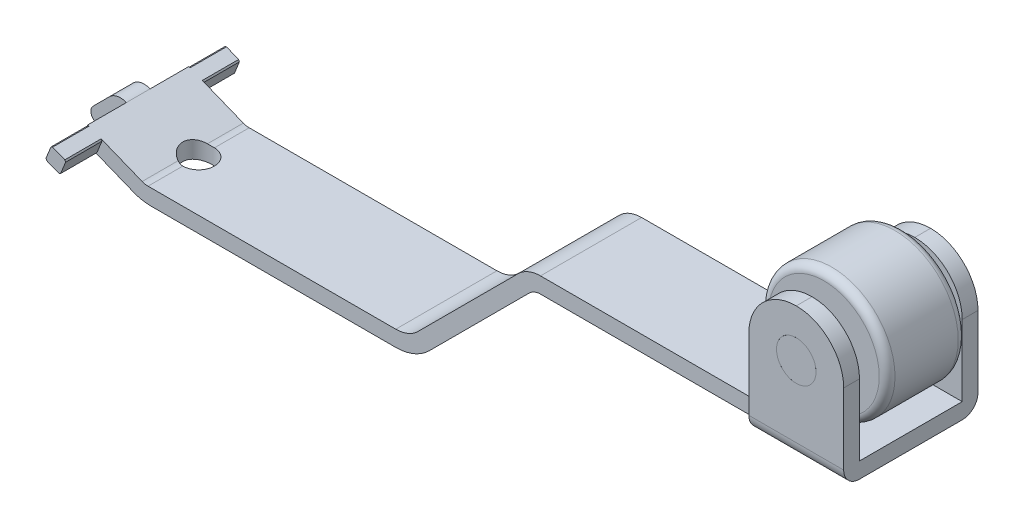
ISO-10303-21;
HEADER;
FILE_DESCRIPTION(('STEP AP214'),'2;1');
FILE_NAME('part.step','',(''),(''),'','','');
FILE_SCHEMA(('AUTOMOTIVE_DESIGN { 1 0 10303 214 1 1 1 1 }'));
ENDSEC;
DATA;
#1=APPLICATION_CONTEXT('core data for automotive mechanical design processes');
#2=APPLICATION_PROTOCOL_DEFINITION('international standard','automotive_design',2000,#1);
#3=PRODUCT_CONTEXT('',#1,'mechanical');
#4=PRODUCT('Part','Part','',(#3));
#5=PRODUCT_RELATED_PRODUCT_CATEGORY('part','',(#4));
#6=PRODUCT_DEFINITION_FORMATION('','',#4);
#7=PRODUCT_DEFINITION_CONTEXT('part definition',#1,'design');
#8=PRODUCT_DEFINITION('design','',#6,#7);
#9=PRODUCT_DEFINITION_SHAPE('','',#8);
#10=(LENGTH_UNIT() NAMED_UNIT(*) SI_UNIT(.MILLI.,.METRE.));
#11=(NAMED_UNIT(*) PLANE_ANGLE_UNIT() SI_UNIT($,.RADIAN.));
#12=(NAMED_UNIT(*) SI_UNIT($,.STERADIAN.) SOLID_ANGLE_UNIT());
#13=UNCERTAINTY_MEASURE_WITH_UNIT(LENGTH_MEASURE(1.E-05),#10,'distance_accuracy_value','');
#14=(GEOMETRIC_REPRESENTATION_CONTEXT(3) GLOBAL_UNCERTAINTY_ASSIGNED_CONTEXT((#13)) GLOBAL_UNIT_ASSIGNED_CONTEXT((#10,
#11,#12)) REPRESENTATION_CONTEXT('',''));
#15=CARTESIAN_POINT('',(0.,0.,0.));
#16=DIRECTION('',(0.,0.,1.));
#17=DIRECTION('',(1.,0.,0.));
#18=AXIS2_PLACEMENT_3D('',#15,#16,#17);
#19=CARTESIAN_POINT('',(45.60617244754,11.2,2.5));
#20=DIRECTION('',(0.,0.,1.));
#21=DIRECTION('',(1.,0.,0.));
#22=AXIS2_PLACEMENT_3D('',#19,#20,#21);
#23=PLANE('',#22);
#24=CARTESIAN_POINT('',(45.60617244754,11.2,2.5));
#25=DIRECTION('',(0.,0.,1.));
#26=DIRECTION('',(1.,0.,0.));
#27=AXIS2_PLACEMENT_3D('',#24,#25,#26);
#28=CIRCLE('',#27,3.50000000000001);
#29=CARTESIAN_POINT('',(49.10617244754,11.2,2.5));
#30=VERTEX_POINT('',#29);
#31=EDGE_CURVE('E12',#30,#30,#28,.T.);
#32=ORIENTED_EDGE('',*,*,#31,.T.);
#33=EDGE_LOOP('',(#32));
#34=FACE_BOUND('',#33,.T.);
#35=CARTESIAN_POINT('',(45.60617244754,11.2,2.5));
#36=DIRECTION('',(0.,0.,1.));
#37=DIRECTION('',(1.,0.,0.));
#38=AXIS2_PLACEMENT_3D('',#35,#36,#37);
#39=CIRCLE('',#38,1.25);
#40=CARTESIAN_POINT('',(46.85617244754,11.2,2.5));
#41=VERTEX_POINT('',#40);
#42=EDGE_CURVE('E62',#41,#41,#39,.T.);
#43=ORIENTED_EDGE('',*,*,#42,.F.);
#44=EDGE_LOOP('',(#43));
#45=FACE_BOUND('',#44,.T.);
#46=ADVANCED_FACE('F42',(#34,#45),#23,.T.);
#47=CARTESIAN_POINT('',(45.60617244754,11.2,-2.5));
#48=DIRECTION('',(0.,0.,1.));
#49=DIRECTION('',(1.,0.,0.));
#50=AXIS2_PLACEMENT_3D('',#47,#48,#49);
#51=PLANE('',#50);
#52=CARTESIAN_POINT('',(45.60617244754,11.2,-2.5));
#53=DIRECTION('',(0.,0.,1.));
#54=DIRECTION('',(1.,0.,0.));
#55=AXIS2_PLACEMENT_3D('',#52,#53,#54);
#56=CIRCLE('',#55,3.50000000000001);
#57=CARTESIAN_POINT('',(49.10617244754,11.2,-2.5));
#58=VERTEX_POINT('',#57);
#59=EDGE_CURVE('E49',#58,#58,#56,.F.);
#60=ORIENTED_EDGE('',*,*,#59,.T.);
#61=EDGE_LOOP('',(#60));
#62=FACE_BOUND('',#61,.T.);
#63=CARTESIAN_POINT('',(45.60617244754,11.2,-2.5));
#64=DIRECTION('',(0.,0.,1.));
#65=DIRECTION('',(1.,0.,0.));
#66=AXIS2_PLACEMENT_3D('',#63,#64,#65);
#67=CIRCLE('',#66,1.25);
#68=CARTESIAN_POINT('',(46.85617244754,11.2,-2.5));
#69=VERTEX_POINT('',#68);
#70=EDGE_CURVE('E63',#69,#69,#67,.T.);
#71=ORIENTED_EDGE('',*,*,#70,.T.);
#72=EDGE_LOOP('',(#71));
#73=FACE_BOUND('',#72,.T.);
#74=ADVANCED_FACE('F73',(#62,#73),#51,.F.);
#75=CARTESIAN_POINT('',(45.60617244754,11.2,2.5));
#76=DIRECTION('',(0.,0.,-1.));
#77=DIRECTION('',(-1.,0.,0.));
#78=AXIS2_PLACEMENT_3D('',#75,#76,#77);
#79=CYLINDRICAL_SURFACE('',#78,4.00000000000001);
#80=CARTESIAN_POINT('',(45.60617244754,11.2,-2.));
#81=DIRECTION('',(0.,0.,1.));
#82=DIRECTION('',(1.,0.,0.));
#83=AXIS2_PLACEMENT_3D('',#80,#81,#82);
#84=CIRCLE('',#83,4.00000000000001);
#85=CARTESIAN_POINT('',(49.60617244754,11.2,-2.));
#86=VERTEX_POINT('',#85);
#87=EDGE_CURVE('E53',#86,#86,#84,.T.);
#88=ORIENTED_EDGE('',*,*,#87,.T.);
#89=EDGE_LOOP('',(#88));
#90=FACE_BOUND('',#89,.T.);
#91=CARTESIAN_POINT('',(45.60617244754,11.2,2.));
#92=DIRECTION('',(0.,0.,1.));
#93=DIRECTION('',(1.,0.,0.));
#94=AXIS2_PLACEMENT_3D('',#91,#92,#93);
#95=CIRCLE('',#94,4.00000000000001);
#96=CARTESIAN_POINT('',(49.60617244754,11.2,2.));
#97=VERTEX_POINT('',#96);
#98=EDGE_CURVE('E57',#97,#97,#95,.F.);
#99=ORIENTED_EDGE('',*,*,#98,.T.);
#100=EDGE_LOOP('',(#99));
#101=FACE_BOUND('',#100,.T.);
#102=ADVANCED_FACE('F78',(#90,#101),#79,.T.);
#103=CARTESIAN_POINT('',(45.60617244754,11.2,2.5));
#104=DIRECTION('',(0.,0.,-1.));
#105=DIRECTION('',(-1.,0.,0.));
#106=AXIS2_PLACEMENT_3D('',#103,#104,#105);
#107=CYLINDRICAL_SURFACE('',#106,1.25);
#108=ORIENTED_EDGE('',*,*,#42,.T.);
#109=EDGE_LOOP('',(#108));
#110=FACE_BOUND('',#109,.T.);
#111=ORIENTED_EDGE('',*,*,#70,.F.);
#112=EDGE_LOOP('',(#111));
#113=FACE_BOUND('',#112,.T.);
#114=ADVANCED_FACE('F69',(#110,#113),#107,.F.);
#115=CARTESIAN_POINT('',(45.60617244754,11.2,-2.));
#116=DIRECTION('',(0.,0.,1.));
#117=DIRECTION('',(1.,0.,0.));
#118=AXIS2_PLACEMENT_3D('',#115,#116,#117);
#119=TOROIDAL_SURFACE('',#118,3.50000000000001,0.5);
#120=ORIENTED_EDGE('',*,*,#59,.F.);
#121=EDGE_LOOP('',(#120));
#122=FACE_BOUND('',#121,.T.);
#123=ORIENTED_EDGE('',*,*,#87,.F.);
#124=EDGE_LOOP('',(#123));
#125=FACE_BOUND('',#124,.T.);
#126=ADVANCED_FACE('F84',(#122,#125),#119,.T.);
#127=CARTESIAN_POINT('',(45.60617244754,11.2,2.));
#128=DIRECTION('',(0.,0.,1.));
#129=DIRECTION('',(1.,0.,0.));
#130=AXIS2_PLACEMENT_3D('',#127,#128,#129);
#131=TOROIDAL_SURFACE('',#130,3.50000000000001,0.5);
#132=ORIENTED_EDGE('',*,*,#98,.F.);
#133=EDGE_LOOP('',(#132));
#134=FACE_BOUND('',#133,.T.);
#135=ORIENTED_EDGE('',*,*,#31,.F.);
#136=EDGE_LOOP('',(#135));
#137=FACE_BOUND('',#136,.T.);
#138=ADVANCED_FACE('F44',(#134,#137),#131,.T.);
#139=CLOSED_SHELL('',(#46,#74,#102,#114,#126,#138));
#140=MANIFOLD_SOLID_BREP('B2',#139);
#141=CARTESIAN_POINT('',(42.60617244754,14.2,-4.25));
#142=DIRECTION('',(0.,0.,-1.));
#143=DIRECTION('',(0.,1.,0.));
#144=AXIS2_PLACEMENT_3D('',#141,#142,#143);
#145=PLANE('',#144);
#146=CARTESIAN_POINT('',(45.60617244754,11.2,-4.25));
#147=DIRECTION('',(0.,0.,-1.));
#148=DIRECTION('',(0.,1.,0.));
#149=AXIS2_PLACEMENT_3D('',#146,#147,#148);
#150=CIRCLE('',#149,1.25);
#151=CARTESIAN_POINT('',(45.60617244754,12.45,-4.25));
#152=VERTEX_POINT('',#151);
#153=EDGE_CURVE('E41',#152,#152,#150,.F.);
#154=ORIENTED_EDGE('',*,*,#153,.F.);
#155=EDGE_LOOP('',(#154));
#156=FACE_BOUND('',#155,.T.);
#157=ADVANCED_FACE('F143',(#156),#145,.T.);
#158=CARTESIAN_POINT('',(45.60617244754,11.2,-7.78553390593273));
#159=DIRECTION('',(0.,0.,1.));
#160=DIRECTION('',(1.,0.,0.));
#161=AXIS2_PLACEMENT_3D('',#158,#159,#160);
#162=CYLINDRICAL_SURFACE('',#161,1.25);
#163=ORIENTED_EDGE('',*,*,#153,.T.);
#164=EDGE_LOOP('',(#163));
#165=FACE_BOUND('',#164,.T.);
#166=CARTESIAN_POINT('',(45.60617244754,11.2,4.25));
#167=DIRECTION('',(0.,0.,1.));
#168=DIRECTION('',(0.,-1.,0.));
#169=AXIS2_PLACEMENT_3D('',#166,#167,#168);
#170=CIRCLE('',#169,1.25);
#171=CARTESIAN_POINT('',(45.60617244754,9.95,4.25));
#172=VERTEX_POINT('',#171);
#173=EDGE_CURVE('E149',#172,#172,#170,.T.);
#174=ORIENTED_EDGE('',*,*,#173,.F.);
#175=EDGE_LOOP('',(#174));
#176=FACE_BOUND('',#175,.T.);
#177=ADVANCED_FACE('F157',(#165,#176),#162,.T.);
#178=CARTESIAN_POINT('',(42.60617244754,14.2,4.25));
#179=DIRECTION('',(0.,0.,1.));
#180=DIRECTION('',(0.,-1.,0.));
#181=AXIS2_PLACEMENT_3D('',#178,#179,#180);
#182=PLANE('',#181);
#183=ORIENTED_EDGE('',*,*,#173,.T.);
#184=EDGE_LOOP('',(#183));
#185=FACE_BOUND('',#184,.T.);
#186=ADVANCED_FACE('F155',(#185),#182,.T.);
#187=CLOSED_SHELL('',(#157,#177,#186));
#188=MANIFOLD_SOLID_BREP('B7',#187);
#189=CARTESIAN_POINT('',(19.2140814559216,1.2,3.2));
#190=DIRECTION('',(0.,0.,1.));
#191=DIRECTION('',(1.,0.,0.));
#192=AXIS2_PLACEMENT_3D('',#189,#190,#191);
#193=PLANE('',#192);
#194=DIRECTION('',(1.,0.,0.));
#195=VECTOR('',#194,1.);
#196=CARTESIAN_POINT('',(28.370935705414,5.7,3.2));
#197=LINE('',#196,#195);
#198=CARTESIAN_POINT('',(28.370935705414,5.7,3.2));
#199=VERTEX_POINT('',#198);
#200=CARTESIAN_POINT('',(42.60617244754,5.7,3.2));
#201=VERTEX_POINT('',#200);
#202=EDGE_CURVE('E798',#199,#201,#197,.T.);
#203=ORIENTED_EDGE('',*,*,#202,.T.);
#204=DIRECTION('',(0.,1.,0.));
#205=VECTOR('',#204,1.);
#206=CARTESIAN_POINT('',(42.60617244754,6.7,3.2));
#207=LINE('',#206,#205);
#208=CARTESIAN_POINT('',(42.60617244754,6.7,3.2));
#209=VERTEX_POINT('',#208);
#210=EDGE_CURVE('E530',#201,#209,#207,.T.);
#211=ORIENTED_EDGE('',*,*,#210,.T.);
#212=DIRECTION('',(-1.,0.,0.));
#213=VECTOR('',#212,1.);
#214=CARTESIAN_POINT('',(28.370935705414,6.7,3.2));
#215=LINE('',#214,#213);
#216=CARTESIAN_POINT('',(28.370935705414,6.7,3.2));
#217=VERTEX_POINT('',#216);
#218=EDGE_CURVE('E545',#209,#217,#215,.T.);
#219=ORIENTED_EDGE('',*,*,#218,.T.);
#220=CARTESIAN_POINT('',(28.370935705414,4.7,3.2));
#221=DIRECTION('',(0.,0.,1.));
#222=DIRECTION('',(1.,0.,0.));
#223=AXIS2_PLACEMENT_3D('',#220,#221,#222);
#224=CIRCLE('',#223,2.);
#225=CARTESIAN_POINT('',(26.9567221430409,6.11421356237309,3.2));
#226=VERTEX_POINT('',#225);
#227=EDGE_CURVE('E801',#217,#226,#224,.T.);
#228=ORIENTED_EDGE('',*,*,#227,.T.);
#229=DIRECTION('',(-0.707106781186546,-0.707106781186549,0.));
#230=VECTOR('',#229,1.);
#231=CARTESIAN_POINT('',(20.6282950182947,-0.214213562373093,3.2));
#232=LINE('',#231,#230);
#233=CARTESIAN_POINT('',(20.6282950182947,-0.214213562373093,3.2));
#234=VERTEX_POINT('',#233);
#235=EDGE_CURVE('E803',#226,#234,#232,.T.);
#236=ORIENTED_EDGE('',*,*,#235,.T.);
#237=CARTESIAN_POINT('',(19.2140814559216,1.2,3.2));
#238=DIRECTION('',(0.,0.,-1.));
#239=DIRECTION('',(1.,0.,0.));
#240=AXIS2_PLACEMENT_3D('',#237,#238,#239);
#241=CIRCLE('',#240,2.);
#242=CARTESIAN_POINT('',(19.2140814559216,-0.8,3.2));
#243=VERTEX_POINT('',#242);
#244=EDGE_CURVE('E805',#234,#243,#241,.T.);
#245=ORIENTED_EDGE('',*,*,#244,.T.);
#246=DIRECTION('',(-1.,0.,0.));
#247=VECTOR('',#246,1.);
#248=CARTESIAN_POINT('',(3.34591714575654,-0.8,3.2));
#249=LINE('',#248,#247);
#250=CARTESIAN_POINT('',(3.53852071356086,-0.8,3.2));
#251=VERTEX_POINT('',#250);
#252=EDGE_CURVE('E807',#243,#251,#249,.T.);
#253=ORIENTED_EDGE('',*,*,#252,.T.);
#254=CARTESIAN_POINT('',(3.53852071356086,0.2,3.2));
#255=DIRECTION('',(0.,0.,1.));
#256=DIRECTION('',(1.,0.,0.));
#257=AXIS2_PLACEMENT_3D('',#254,#255,#256);
#258=CIRCLE('',#257,1.);
#259=CARTESIAN_POINT('',(3.16709214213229,-0.728461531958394,3.2));
#260=VERTEX_POINT('',#259);
#261=EDGE_CURVE('E976',#251,#260,#258,.F.);
#262=ORIENTED_EDGE('',*,*,#261,.T.);
#263=DIRECTION('',(-0.928461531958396,0.371428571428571,0.));
#264=VECTOR('',#263,1.);
#265=CARTESIAN_POINT('',(0.185714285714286,0.464230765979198,3.2));
#266=LINE('',#265,#264);
#267=CARTESIAN_POINT('',(0.57133332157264,0.309964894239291,3.2));
#268=VERTEX_POINT('',#267);
#269=EDGE_CURVE('E810',#260,#268,#266,.T.);
#270=ORIENTED_EDGE('',*,*,#269,.T.);
#271=CARTESIAN_POINT('',(0.,0.,3.2));
#272=DIRECTION('',(0.,0.,1.));
#273=DIRECTION('',(1.,0.,0.));
#274=AXIS2_PLACEMENT_3D('',#271,#272,#273);
#275=CIRCLE('',#274,0.65);
#276=CARTESIAN_POINT('',(0.618496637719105,0.199904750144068,3.2));
#277=VERTEX_POINT('',#276);
#278=EDGE_CURVE('E732',#268,#277,#275,.F.);
#279=ORIENTED_EDGE('',*,*,#278,.T.);
#280=DIRECTION('',(-0.371428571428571,-0.928461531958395,0.));
#281=VECTOR('',#280,1.);
#282=CARTESIAN_POINT('',(3.52881832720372,7.47484788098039,3.2));
#283=LINE('',#282,#281);
#284=CARTESIAN_POINT('',(0.309964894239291,-0.571333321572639,3.2));
#285=VERTEX_POINT('',#284);
#286=EDGE_CURVE('E775',#277,#285,#283,.T.);
#287=ORIENTED_EDGE('',*,*,#286,.T.);
#288=CARTESIAN_POINT('',(0.199904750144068,-0.618496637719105,3.2));
#289=VERTEX_POINT('',#288);
#290=EDGE_CURVE('E733',#285,#289,#275,.F.);
#291=ORIENTED_EDGE('',*,*,#290,.T.);
#292=DIRECTION('',(0.928461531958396,-0.371428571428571,0.));
#293=VECTOR('',#292,1.);
#294=CARTESIAN_POINT('',(-0.649945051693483,-0.278516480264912,3.2));
#295=LINE('',#294,#293);
#296=CARTESIAN_POINT('',(2.61683856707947,-1.58538459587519,3.2));
#297=VERTEX_POINT('',#296);
#298=EDGE_CURVE('E812',#289,#297,#295,.T.);
#299=ORIENTED_EDGE('',*,*,#298,.T.);
#300=CARTESIAN_POINT('',(3.73112428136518,1.2,3.2));
#301=DIRECTION('',(0.,0.,1.));
#302=DIRECTION('',(1.,0.,0.));
#303=AXIS2_PLACEMENT_3D('',#300,#301,#302);
#304=CIRCLE('',#303,3.);
#305=CARTESIAN_POINT('',(3.73112428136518,-1.8,3.2));
#306=VERTEX_POINT('',#305);
#307=EDGE_CURVE('E983',#297,#306,#304,.T.);
#308=ORIENTED_EDGE('',*,*,#307,.T.);
#309=DIRECTION('',(1.,0.,0.));
#310=VECTOR('',#309,1.);
#311=CARTESIAN_POINT('',(3.15331357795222,-1.8,3.2));
#312=LINE('',#311,#310);
#313=CARTESIAN_POINT('',(19.2140814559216,-1.8,3.2));
#314=VERTEX_POINT('',#313);
#315=EDGE_CURVE('E789',#306,#314,#312,.T.);
#316=ORIENTED_EDGE('',*,*,#315,.T.);
#317=CARTESIAN_POINT('',(19.2140814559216,1.2,3.2));
#318=DIRECTION('',(0.,0.,1.));
#319=DIRECTION('',(1.,0.,0.));
#320=AXIS2_PLACEMENT_3D('',#317,#318,#319);
#321=CIRCLE('',#320,3.);
#322=CARTESIAN_POINT('',(21.3354017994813,-0.921320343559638,3.2));
#323=VERTEX_POINT('',#322);
#324=EDGE_CURVE('E791',#314,#323,#321,.T.);
#325=ORIENTED_EDGE('',*,*,#324,.T.);
#326=DIRECTION('',(0.707106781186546,0.707106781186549,0.));
#327=VECTOR('',#326,1.);
#328=CARTESIAN_POINT('',(21.3354017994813,-0.921320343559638,3.2));
#329=LINE('',#328,#327);
#330=CARTESIAN_POINT('',(27.6638289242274,5.40710678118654,3.2));
#331=VERTEX_POINT('',#330);
#332=EDGE_CURVE('E794',#323,#331,#329,.T.);
#333=ORIENTED_EDGE('',*,*,#332,.T.);
#334=CARTESIAN_POINT('',(28.370935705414,4.7,3.2));
#335=DIRECTION('',(0.,0.,-1.));
#336=DIRECTION('',(-1.,0.,0.));
#337=AXIS2_PLACEMENT_3D('',#334,#335,#336);
#338=CIRCLE('',#337,1.);
#339=EDGE_CURVE('E796',#331,#199,#338,.T.);
#340=ORIENTED_EDGE('',*,*,#339,.T.);
#341=EDGE_LOOP('',(#203,#211,#219,#228,#236,#245,#253,#262,#270,#279,#287,#291,#299,#308,#316,
#325,#333,#340));
#342=FACE_BOUND('',#341,.T.);
#343=ADVANCED_FACE('F184',(#342),#193,.T.);
#344=CARTESIAN_POINT('',(3.73112428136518,1.2,3.2));
#345=DIRECTION('',(0.,0.,-1.));
#346=DIRECTION('',(-1.,0.,0.));
#347=AXIS2_PLACEMENT_3D('',#344,#345,#346);
#348=CYLINDRICAL_SURFACE('',#347,3.);
#349=CARTESIAN_POINT('',(2.61683856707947,-1.58538459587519,-0.387945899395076));
#350=CARTESIAN_POINT('',(2.639047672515,-1.59426285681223,-0.440770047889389));
#351=CARTESIAN_POINT('',(2.66571598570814,-1.60463297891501,-0.491380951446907));
#352=CARTESIAN_POINT('',(2.72699278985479,-1.62715226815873,-0.587054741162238));
#353=CARTESIAN_POINT('',(2.76159483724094,-1.63929998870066,-0.632122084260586));
#354=CARTESIAN_POINT('',(2.83776356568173,-1.66417616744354,-0.715636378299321));
#355=CARTESIAN_POINT('',(2.87932357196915,-1.67690406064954,-0.754089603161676));
#356=CARTESIAN_POINT('',(2.96843372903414,-1.70179977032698,-0.823522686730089));
#357=CARTESIAN_POINT('',(3.01598406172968,-1.7139675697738,-0.854502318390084));
#358=CARTESIAN_POINT('',(3.1167874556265,-1.73688632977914,-0.908550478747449));
#359=CARTESIAN_POINT('',(3.17012227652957,-1.74761033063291,-0.931478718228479));
#360=CARTESIAN_POINT('',(3.28035079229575,-1.76646697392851,-0.967840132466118));
#361=CARTESIAN_POINT('',(3.33724266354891,-1.7746009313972,-0.981278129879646));
#362=CARTESIAN_POINT('',(3.45048145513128,-1.78736378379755,-0.997686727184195));
#363=CARTESIAN_POINT('',(3.50675199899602,-1.79212481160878,-1.00107083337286));
#364=CARTESIAN_POINT('',(3.59114023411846,-1.79686651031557,-0.999014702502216));
#365=CARTESIAN_POINT('',(3.6193198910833,-1.79804704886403,-0.997130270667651));
#366=CARTESIAN_POINT('',(3.67544696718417,-1.79961498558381,-0.990983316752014));
#367=CARTESIAN_POINT('',(3.7033943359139,-1.80000221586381,-0.986720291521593));
#368=CARTESIAN_POINT('',(3.73112428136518,-1.8,-0.981276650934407));
#369=B_SPLINE_CURVE_WITH_KNOTS('',3,(#349,#350,#351,#352,#353,#354,#355,#356,#357,#358,#359,
#360,#361,#362,#363,#364,#365,#366,#367,#368),.UNSPECIFIED.,.F.,.F.,(4,2,2,2,2,2,2,2,2,4),(0.,
0.173622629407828,0.347104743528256,0.520421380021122,0.693743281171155,0.869950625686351,
1.0460683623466,1.2148347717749,1.29953835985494,1.38425987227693),.UNSPECIFIED.);
#370=CARTESIAN_POINT('',(2.61683856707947,-1.58538459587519,-0.387945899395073));
#371=VERTEX_POINT('',#370);
#372=CARTESIAN_POINT('',(3.73112428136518,-1.8,-0.981276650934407));
#373=VERTEX_POINT('',#372);
#374=EDGE_CURVE('E638',#371,#373,#369,.T.);
#375=ORIENTED_EDGE('',*,*,#374,.F.);
#376=DIRECTION('',(0.,0.,-1.));
#377=VECTOR('',#376,1.);
#378=CARTESIAN_POINT('',(2.61683856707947,-1.58538459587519,3.2));
#379=LINE('',#378,#377);
#380=CARTESIAN_POINT('',(2.61683856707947,-1.58538459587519,-3.2));
#381=VERTEX_POINT('',#380);
#382=EDGE_CURVE('E1537',#381,#371,#379,.F.);
#383=ORIENTED_EDGE('',*,*,#382,.F.);
#384=CARTESIAN_POINT('',(3.73112428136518,1.2,-3.2));
#385=DIRECTION('',(0.,0.,1.));
#386=DIRECTION('',(1.,0.,0.));
#387=AXIS2_PLACEMENT_3D('',#384,#385,#386);
#388=CIRCLE('',#387,3.);
#389=CARTESIAN_POINT('',(3.73112428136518,-1.8,-3.2));
#390=VERTEX_POINT('',#389);
#391=EDGE_CURVE('E1530',#390,#381,#388,.F.);
#392=ORIENTED_EDGE('',*,*,#391,.F.);
#393=DIRECTION('',(0.,0.,-1.));
#394=VECTOR('',#393,1.);
#395=CARTESIAN_POINT('',(3.73112428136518,-1.8,3.2));
#396=LINE('',#395,#394);
#397=EDGE_CURVE('E855',#373,#390,#396,.T.);
#398=ORIENTED_EDGE('',*,*,#397,.F.);
#399=EDGE_LOOP('',(#375,#383,#392,#398));
#400=FACE_BOUND('',#399,.T.);
#401=ADVANCED_FACE('F1050',(#400),#348,.T.);
#402=CARTESIAN_POINT('',(3.53852071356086,0.2,3.2));
#403=DIRECTION('',(0.,0.,1.));
#404=DIRECTION('',(1.,0.,0.));
#405=AXIS2_PLACEMENT_3D('',#402,#403,#404);
#406=CYLINDRICAL_SURFACE('',#405,1.);
#407=DIRECTION('',(0.,0.,-1.));
#408=VECTOR('',#407,1.);
#409=CARTESIAN_POINT('',(3.53852071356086,-0.8,3.2));
#410=LINE('',#409,#408);
#411=CARTESIAN_POINT('',(3.53852071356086,-0.8,1.));
#412=VERTEX_POINT('',#411);
#413=EDGE_CURVE('E978',#412,#251,#410,.F.);
#414=ORIENTED_EDGE('',*,*,#413,.F.);
#415=CARTESIAN_POINT('',(3.53852071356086,0.2,0.));
#416=DIRECTION('',(0.,0.707106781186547,0.707106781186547));
#417=DIRECTION('',(0.,-0.707106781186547,0.707106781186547));
#418=AXIS2_PLACEMENT_3D('',#415,#416,#417);
#419=ELLIPSE('',#418,1.41421356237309,1.);
#420=CARTESIAN_POINT('',(3.16709214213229,-0.728461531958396,0.928461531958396));
#421=VERTEX_POINT('',#420);
#422=EDGE_CURVE('E977',#412,#421,#419,.F.);
#423=ORIENTED_EDGE('',*,*,#422,.T.);
#424=DIRECTION('',(0.,0.,-1.));
#425=VECTOR('',#424,1.);
#426=CARTESIAN_POINT('',(3.16709214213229,-0.728461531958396,-3.2));
#427=LINE('',#426,#425);
#428=EDGE_CURVE('E970',#260,#421,#427,.T.);
#429=ORIENTED_EDGE('',*,*,#428,.F.);
#430=ORIENTED_EDGE('',*,*,#261,.F.);
#431=EDGE_LOOP('',(#414,#423,#429,#430));
#432=FACE_BOUND('',#431,.T.);
#433=ADVANCED_FACE('F975',(#432),#406,.F.);
#434=CARTESIAN_POINT('',(-0.278516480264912,0.649945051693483,3.2));
#435=DIRECTION('',(0.928461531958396,-0.371428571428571,0.));
#436=DIRECTION('',(0.371428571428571,0.928461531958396,0.));
#437=AXIS2_PLACEMENT_3D('',#434,#435,#436);
#438=PLANE('',#437);
#439=DIRECTION('',(0.371428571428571,0.928461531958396,0.));
#440=VECTOR('',#439,1.);
#441=CARTESIAN_POINT('',(-0.278516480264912,0.649945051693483,0.75));
#442=LINE('',#441,#440);
#443=CARTESIAN_POINT('',(-0.649945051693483,-0.278516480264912,0.75));
#444=VERTEX_POINT('',#443);
#445=CARTESIAN_POINT('',(-0.278516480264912,0.649945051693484,0.75));
#446=VERTEX_POINT('',#445);
#447=EDGE_CURVE('E649',#444,#446,#442,.T.);
#448=ORIENTED_EDGE('',*,*,#447,.F.);
#449=DIRECTION('',(0.,0.,-1.));
#450=VECTOR('',#449,1.);
#451=CARTESIAN_POINT('',(-0.649945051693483,-0.278516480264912,3.2));
#452=LINE('',#451,#450);
#453=CARTESIAN_POINT('',(-0.649945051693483,-0.278516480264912,3.2));
#454=VERTEX_POINT('',#453);
#455=EDGE_CURVE('E849',#454,#444,#452,.T.);
#456=ORIENTED_EDGE('',*,*,#455,.F.);
#457=DIRECTION('',(-0.371428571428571,-0.928461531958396,0.));
#458=VECTOR('',#457,1.);
#459=CARTESIAN_POINT('',(-0.278516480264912,0.649945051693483,3.2));
#460=LINE('',#459,#458);
#461=CARTESIAN_POINT('',(-0.618496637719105,-0.199904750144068,3.2));
#462=VERTEX_POINT('',#461);
#463=EDGE_CURVE('E760',#462,#454,#460,.T.);
#464=ORIENTED_EDGE('',*,*,#463,.F.);
#465=DIRECTION('',(0.,0.,1.));
#466=VECTOR('',#465,1.);
#467=CARTESIAN_POINT('',(-0.618496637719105,-0.199904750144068,-47.2865977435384));
#468=LINE('',#467,#466);
#469=CARTESIAN_POINT('',(-0.618496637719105,-0.199904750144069,5.5));
#470=VERTEX_POINT('',#469);
#471=EDGE_CURVE('E746',#470,#462,#468,.F.);
#472=ORIENTED_EDGE('',*,*,#471,.F.);
#473=DIRECTION('',(-0.371428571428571,-0.928461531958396,0.));
#474=VECTOR('',#473,1.);
#475=CARTESIAN_POINT('',(-0.278516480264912,0.649945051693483,5.5));
#476=LINE('',#475,#474);
#477=CARTESIAN_POINT('',(-0.309964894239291,0.57133332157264,5.5));
#478=VERTEX_POINT('',#477);
#479=EDGE_CURVE('E765',#478,#470,#476,.T.);
#480=ORIENTED_EDGE('',*,*,#479,.F.);
#481=DIRECTION('',(0.,0.,1.));
#482=VECTOR('',#481,1.);
#483=CARTESIAN_POINT('',(-0.309964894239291,0.57133332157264,-47.2865977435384));
#484=LINE('',#483,#482);
#485=CARTESIAN_POINT('',(-0.309964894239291,0.57133332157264,3.2));
#486=VERTEX_POINT('',#485);
#487=EDGE_CURVE('E748',#486,#478,#484,.T.);
#488=ORIENTED_EDGE('',*,*,#487,.F.);
#489=CARTESIAN_POINT('',(-0.278516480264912,0.649945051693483,3.2));
#490=VERTEX_POINT('',#489);
#491=EDGE_CURVE('E758',#490,#486,#460,.T.);
#492=ORIENTED_EDGE('',*,*,#491,.F.);
#493=DIRECTION('',(0.,0.,-1.));
#494=VECTOR('',#493,1.);
#495=CARTESIAN_POINT('',(-0.278516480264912,0.649945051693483,3.2));
#496=LINE('',#495,#494);
#497=EDGE_CURVE('E892',#490,#446,#496,.T.);
#498=ORIENTED_EDGE('',*,*,#497,.T.);
#499=EDGE_LOOP('',(#448,#456,#464,#472,#480,#488,#492,#498));
#500=FACE_BOUND('',#499,.T.);
#501=ADVANCED_FACE('F926',(#500),#438,.F.);
#502=CARTESIAN_POINT('',(0.185714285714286,0.464230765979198,3.2));
#503=DIRECTION('',(-0.371428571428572,-0.928461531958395,0.));
#504=DIRECTION('',(0.928461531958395,-0.371428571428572,0.));
#505=AXIS2_PLACEMENT_3D('',#502,#503,#504);
#506=PLANE('',#505);
#507=ORIENTED_EDGE('',*,*,#428,.T.);
#508=CARTESIAN_POINT('',(3.53852071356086,-0.877050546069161,0.));
#509=DIRECTION('',(-0.371428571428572,-0.928461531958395,0.));
#510=DIRECTION('',(-0.928461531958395,0.371428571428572,0.));
#511=AXIS2_PLACEMENT_3D('',#508,#509,#510);
#512=ELLIPSE('',#511,1.07705054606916,1.);
#513=CARTESIAN_POINT('',(3.16709214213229,-0.728461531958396,-0.928461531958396));
#514=VERTEX_POINT('',#513);
#515=EDGE_CURVE('E609',#421,#514,#512,.T.);
#516=ORIENTED_EDGE('',*,*,#515,.T.);
#517=CARTESIAN_POINT('',(3.16709214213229,-0.728461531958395,-3.2));
#518=VERTEX_POINT('',#517);
#519=EDGE_CURVE('E979',#514,#518,#427,.T.);
#520=ORIENTED_EDGE('',*,*,#519,.T.);
#521=DIRECTION('',(-0.928461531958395,0.371428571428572,0.));
#522=VECTOR('',#521,1.);
#523=CARTESIAN_POINT('',(0.185714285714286,0.464230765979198,-3.2));
#524=LINE('',#523,#522);
#525=CARTESIAN_POINT('',(0.57133332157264,0.309964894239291,-3.2));
#526=VERTEX_POINT('',#525);
#527=EDGE_CURVE('E837',#518,#526,#524,.T.);
#528=ORIENTED_EDGE('',*,*,#527,.T.);
#529=DIRECTION('',(0.,0.,-1.));
#530=VECTOR('',#529,1.);
#531=CARTESIAN_POINT('',(0.57133332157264,0.309964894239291,47.2865977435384));
#532=LINE('',#531,#530);
#533=CARTESIAN_POINT('',(0.57133332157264,0.309964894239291,-5.5));
#534=VERTEX_POINT('',#533);
#535=EDGE_CURVE('E724',#534,#526,#532,.F.);
#536=ORIENTED_EDGE('',*,*,#535,.F.);
#537=DIRECTION('',(-0.928461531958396,0.371428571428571,0.));
#538=VECTOR('',#537,1.);
#539=CARTESIAN_POINT('',(-0.278516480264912,0.649945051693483,-5.5));
#540=LINE('',#539,#538);
#541=CARTESIAN_POINT('',(-0.199904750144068,0.618496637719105,-5.5));
#542=VERTEX_POINT('',#541);
#543=EDGE_CURVE('E757',#534,#542,#540,.T.);
#544=ORIENTED_EDGE('',*,*,#543,.T.);
#545=DIRECTION('',(0.,0.,-1.));
#546=VECTOR('',#545,1.);
#547=CARTESIAN_POINT('',(-0.199904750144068,0.618496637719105,47.2865977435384));
#548=LINE('',#547,#546);
#549=CARTESIAN_POINT('',(-0.199904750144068,0.618496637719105,-3.2));
#550=VERTEX_POINT('',#549);
#551=EDGE_CURVE('E727',#550,#542,#548,.T.);
#552=ORIENTED_EDGE('',*,*,#551,.F.);
#553=DIRECTION('',(-0.928461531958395,0.371428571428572,0.));
#554=VECTOR('',#553,1.);
#555=CARTESIAN_POINT('',(0.185714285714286,0.464230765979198,-3.2));
#556=LINE('',#555,#554);
#557=CARTESIAN_POINT('',(-0.278516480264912,0.649945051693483,-3.2));
#558=VERTEX_POINT('',#557);
#559=EDGE_CURVE('E707',#550,#558,#556,.T.);
#560=ORIENTED_EDGE('',*,*,#559,.T.);
#561=CARTESIAN_POINT('',(-0.278516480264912,0.649945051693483,-0.75));
#562=VERTEX_POINT('',#561);
#563=EDGE_CURVE('E852',#562,#558,#496,.T.);
#564=ORIENTED_EDGE('',*,*,#563,.F.);
#565=DIRECTION('',(0.,0.,-1.));
#566=VECTOR('',#565,1.);
#567=CARTESIAN_POINT('',(-0.278516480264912,0.649945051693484,0.75));
#568=LINE('',#567,#566);
#569=EDGE_CURVE('E657',#446,#562,#568,.T.);
#570=ORIENTED_EDGE('',*,*,#569,.F.);
#571=ORIENTED_EDGE('',*,*,#497,.F.);
#572=DIRECTION('',(-0.928461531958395,0.371428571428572,0.));
#573=VECTOR('',#572,1.);
#574=CARTESIAN_POINT('',(0.185714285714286,0.464230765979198,3.2));
#575=LINE('',#574,#573);
#576=CARTESIAN_POINT('',(-0.199904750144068,0.618496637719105,3.2));
#577=VERTEX_POINT('',#576);
#578=EDGE_CURVE('E755',#577,#490,#575,.T.);
#579=ORIENTED_EDGE('',*,*,#578,.F.);
#580=DIRECTION('',(0.,0.,1.));
#581=VECTOR('',#580,1.);
#582=CARTESIAN_POINT('',(-0.199904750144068,0.618496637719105,-47.2865977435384));
#583=LINE('',#582,#581);
#584=CARTESIAN_POINT('',(-0.199904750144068,0.618496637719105,5.5));
#585=VERTEX_POINT('',#584);
#586=EDGE_CURVE('E750',#585,#577,#583,.F.);
#587=ORIENTED_EDGE('',*,*,#586,.F.);
#588=DIRECTION('',(-0.928461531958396,0.371428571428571,0.));
#589=VECTOR('',#588,1.);
#590=CARTESIAN_POINT('',(-0.278516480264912,0.649945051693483,5.5));
#591=LINE('',#590,#589);
#592=CARTESIAN_POINT('',(0.57133332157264,0.309964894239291,5.5));
#593=VERTEX_POINT('',#592);
#594=EDGE_CURVE('E762',#593,#585,#591,.T.);
#595=ORIENTED_EDGE('',*,*,#594,.F.);
#596=DIRECTION('',(0.,0.,1.));
#597=VECTOR('',#596,1.);
#598=CARTESIAN_POINT('',(0.57133332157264,0.309964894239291,-47.2865977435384));
#599=LINE('',#598,#597);
#600=EDGE_CURVE('E752',#268,#593,#599,.T.);
#601=ORIENTED_EDGE('',*,*,#600,.F.);
#602=ORIENTED_EDGE('',*,*,#269,.F.);
#603=EDGE_LOOP('',(#507,#516,#520,#528,#536,#544,#552,#560,#564,#570,#571,#579,#587,#595,#601,#602));
#604=FACE_BOUND('',#603,.T.);
#605=ADVANCED_FACE('F967',(#604),#506,.F.);
#606=CARTESIAN_POINT('',(-0.649945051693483,-0.278516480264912,-0.75));
#607=VERTEX_POINT('',#606);
#608=CARTESIAN_POINT('',(-0.649945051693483,-0.278516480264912,-3.2));
#609=VERTEX_POINT('',#608);
#610=EDGE_CURVE('E815',#607,#609,#452,.T.);
#611=ORIENTED_EDGE('',*,*,#610,.F.);
#612=DIRECTION('',(0.371428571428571,0.928461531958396,0.));
#613=VECTOR('',#612,1.);
#614=CARTESIAN_POINT('',(-0.278516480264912,0.649945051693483,-0.75));
#615=LINE('',#614,#613);
#616=EDGE_CURVE('E643',#607,#562,#615,.T.);
#617=ORIENTED_EDGE('',*,*,#616,.T.);
#618=ORIENTED_EDGE('',*,*,#563,.T.);
#619=DIRECTION('',(-0.371428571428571,-0.928461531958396,0.));
#620=VECTOR('',#619,1.);
#621=CARTESIAN_POINT('',(-0.278516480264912,0.649945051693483,-3.2));
#622=LINE('',#621,#620);
#623=CARTESIAN_POINT('',(-0.309964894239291,0.57133332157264,-3.2));
#624=VERTEX_POINT('',#623);
#625=EDGE_CURVE('E711',#558,#624,#622,.T.);
#626=ORIENTED_EDGE('',*,*,#625,.T.);
#627=DIRECTION('',(0.,0.,-1.));
#628=VECTOR('',#627,1.);
#629=CARTESIAN_POINT('',(-0.309964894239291,0.57133332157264,47.2865977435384));
#630=LINE('',#629,#628);
#631=CARTESIAN_POINT('',(-0.309964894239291,0.57133332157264,-5.5));
#632=VERTEX_POINT('',#631);
#633=EDGE_CURVE('E720',#632,#624,#630,.F.);
#634=ORIENTED_EDGE('',*,*,#633,.F.);
#635=DIRECTION('',(-0.371428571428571,-0.928461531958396,0.));
#636=VECTOR('',#635,1.);
#637=CARTESIAN_POINT('',(-0.278516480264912,0.649945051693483,-5.5));
#638=LINE('',#637,#636);
#639=CARTESIAN_POINT('',(-0.618496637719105,-0.199904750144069,-5.5));
#640=VERTEX_POINT('',#639);
#641=EDGE_CURVE('E778',#632,#640,#638,.T.);
#642=ORIENTED_EDGE('',*,*,#641,.T.);
#643=DIRECTION('',(0.,0.,-1.));
#644=VECTOR('',#643,1.);
#645=CARTESIAN_POINT('',(-0.618496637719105,-0.199904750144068,47.2865977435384));
#646=LINE('',#645,#644);
#647=CARTESIAN_POINT('',(-0.618496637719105,-0.199904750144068,-3.2));
#648=VERTEX_POINT('',#647);
#649=EDGE_CURVE('E722',#648,#640,#646,.T.);
#650=ORIENTED_EDGE('',*,*,#649,.F.);
#651=EDGE_CURVE('E714',#648,#609,#622,.T.);
#652=ORIENTED_EDGE('',*,*,#651,.T.);
#653=EDGE_LOOP('',(#611,#617,#618,#626,#634,#642,#650,#652));
#654=FACE_BOUND('',#653,.T.);
#655=ADVANCED_FACE('F1182',(#654),#438,.F.);
#656=CARTESIAN_POINT('',(-0.185714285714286,-0.464230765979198,3.2));
#657=DIRECTION('',(0.371428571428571,0.928461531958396,0.));
#658=DIRECTION('',(-0.928461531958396,0.371428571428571,0.));
#659=AXIS2_PLACEMENT_3D('',#656,#657,#658);
#660=PLANE('',#659);
#661=ORIENTED_EDGE('',*,*,#382,.T.);
#662=CARTESIAN_POINT('',(3.53852071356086,-1.95410109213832,0.));
#663=DIRECTION('',(0.371428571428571,0.928461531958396,0.));
#664=DIRECTION('',(-0.928461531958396,0.371428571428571,0.));
#665=AXIS2_PLACEMENT_3D('',#662,#663,#664);
#666=ELLIPSE('',#665,1.07705054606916,1.);
#667=CARTESIAN_POINT('',(2.61683856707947,-1.58538459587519,0.387945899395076));
#668=VERTEX_POINT('',#667);
#669=EDGE_CURVE('E619',#371,#668,#666,.T.);
#670=ORIENTED_EDGE('',*,*,#669,.T.);
#671=EDGE_CURVE('E1532',#668,#297,#379,.F.);
#672=ORIENTED_EDGE('',*,*,#671,.T.);
#673=ORIENTED_EDGE('',*,*,#298,.F.);
#674=DIRECTION('',(0.,0.,1.));
#675=VECTOR('',#674,1.);
#676=CARTESIAN_POINT('',(0.199904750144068,-0.618496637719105,-47.2865977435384));
#677=LINE('',#676,#675);
#678=CARTESIAN_POINT('',(0.199904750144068,-0.618496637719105,5.5));
#679=VERTEX_POINT('',#678);
#680=EDGE_CURVE('E741',#679,#289,#677,.F.);
#681=ORIENTED_EDGE('',*,*,#680,.F.);
#682=DIRECTION('',(0.928461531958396,-0.371428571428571,0.));
#683=VECTOR('',#682,1.);
#684=CARTESIAN_POINT('',(-0.649945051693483,-0.278516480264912,5.5));
#685=LINE('',#684,#683);
#686=CARTESIAN_POINT('',(-0.571333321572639,-0.309964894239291,5.5));
#687=VERTEX_POINT('',#686);
#688=EDGE_CURVE('E769',#687,#679,#685,.T.);
#689=ORIENTED_EDGE('',*,*,#688,.F.);
#690=DIRECTION('',(0.,0.,1.));
#691=VECTOR('',#690,1.);
#692=CARTESIAN_POINT('',(-0.57133332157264,-0.309964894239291,-47.2865977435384));
#693=LINE('',#692,#691);
#694=CARTESIAN_POINT('',(-0.57133332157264,-0.309964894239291,3.2));
#695=VERTEX_POINT('',#694);
#696=EDGE_CURVE('E744',#695,#687,#693,.T.);
#697=ORIENTED_EDGE('',*,*,#696,.F.);
#698=DIRECTION('',(0.928461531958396,-0.371428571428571,0.));
#699=VECTOR('',#698,1.);
#700=CARTESIAN_POINT('',(-0.185714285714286,-0.464230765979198,3.2));
#701=LINE('',#700,#699);
#702=EDGE_CURVE('E754',#454,#695,#701,.T.);
#703=ORIENTED_EDGE('',*,*,#702,.F.);
#704=ORIENTED_EDGE('',*,*,#455,.T.);
#705=DIRECTION('',(0.,0.,-1.));
#706=VECTOR('',#705,1.);
#707=CARTESIAN_POINT('',(-0.649945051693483,-0.278516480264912,0.75));
#708=LINE('',#707,#706);
#709=EDGE_CURVE('E667',#444,#607,#708,.T.);
#710=ORIENTED_EDGE('',*,*,#709,.T.);
#711=ORIENTED_EDGE('',*,*,#610,.T.);
#712=DIRECTION('',(0.928461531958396,-0.371428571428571,0.));
#713=VECTOR('',#712,1.);
#714=CARTESIAN_POINT('',(-0.185714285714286,-0.464230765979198,-3.2));
#715=LINE('',#714,#713);
#716=CARTESIAN_POINT('',(-0.57133332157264,-0.309964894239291,-3.2));
#717=VERTEX_POINT('',#716);
#718=EDGE_CURVE('E705',#609,#717,#715,.T.);
#719=ORIENTED_EDGE('',*,*,#718,.T.);
#720=DIRECTION('',(0.,0.,-1.));
#721=VECTOR('',#720,1.);
#722=CARTESIAN_POINT('',(-0.57133332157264,-0.309964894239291,47.2865977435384));
#723=LINE('',#722,#721);
#724=CARTESIAN_POINT('',(-0.571333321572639,-0.309964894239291,-5.5));
#725=VERTEX_POINT('',#724);
#726=EDGE_CURVE('E710',#725,#717,#723,.F.);
#727=ORIENTED_EDGE('',*,*,#726,.F.);
#728=DIRECTION('',(0.928461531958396,-0.371428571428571,0.));
#729=VECTOR('',#728,1.);
#730=CARTESIAN_POINT('',(-0.649945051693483,-0.278516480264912,-5.5));
#731=LINE('',#730,#729);
#732=CARTESIAN_POINT('',(0.199904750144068,-0.618496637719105,-5.5));
#733=VERTEX_POINT('',#732);
#734=EDGE_CURVE('E781',#725,#733,#731,.T.);
#735=ORIENTED_EDGE('',*,*,#734,.T.);
#736=DIRECTION('',(0.,0.,-1.));
#737=VECTOR('',#736,1.);
#738=CARTESIAN_POINT('',(0.199904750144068,-0.618496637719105,47.2865977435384));
#739=LINE('',#738,#737);
#740=CARTESIAN_POINT('',(0.199904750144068,-0.618496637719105,-3.2));
#741=VERTEX_POINT('',#740);
#742=EDGE_CURVE('E718',#741,#733,#739,.T.);
#743=ORIENTED_EDGE('',*,*,#742,.F.);
#744=DIRECTION('',(0.928461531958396,-0.371428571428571,0.));
#745=VECTOR('',#744,1.);
#746=CARTESIAN_POINT('',(-0.185714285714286,-0.464230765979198,-3.2));
#747=LINE('',#746,#745);
#748=EDGE_CURVE('E792',#741,#381,#747,.T.);
#749=ORIENTED_EDGE('',*,*,#748,.T.);
#750=EDGE_LOOP('',(#661,#670,#672,#673,#681,#689,#697,#703,#704,#710,#711,#719,#727,#735,#743,#749));
#751=FACE_BOUND('',#750,.T.);
#752=ADVANCED_FACE('F920',(#751),#660,.F.);
#753=CARTESIAN_POINT('',(0.649945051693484,0.278516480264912,-5.5));
#754=DIRECTION('',(0.,0.,-1.));
#755=DIRECTION('',(-1.,0.,0.));
#756=AXIS2_PLACEMENT_3D('',#753,#754,#755);
#757=PLANE('',#756);
#758=ORIENTED_EDGE('',*,*,#641,.F.);
#759=CARTESIAN_POINT('',(0.,0.,-5.5));
#760=DIRECTION('',(0.,0.,-1.));
#761=DIRECTION('',(-1.,0.,0.));
#762=AXIS2_PLACEMENT_3D('',#759,#760,#761);
#763=CIRCLE('',#762,0.65);
#764=EDGE_CURVE('E697',#632,#542,#763,.T.);
#765=ORIENTED_EDGE('',*,*,#764,.T.);
#766=ORIENTED_EDGE('',*,*,#543,.F.);
#767=CARTESIAN_POINT('',(0.618496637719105,0.199904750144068,-5.5));
#768=VERTEX_POINT('',#767);
#769=EDGE_CURVE('E701',#534,#768,#763,.T.);
#770=ORIENTED_EDGE('',*,*,#769,.T.);
#771=DIRECTION('',(0.371428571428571,0.928461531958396,0.));
#772=VECTOR('',#771,1.);
#773=CARTESIAN_POINT('',(0.649945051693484,0.278516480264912,-5.5));
#774=LINE('',#773,#772);
#775=CARTESIAN_POINT('',(0.309964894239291,-0.571333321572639,-5.5));
#776=VERTEX_POINT('',#775);
#777=EDGE_CURVE('E766',#776,#768,#774,.T.);
#778=ORIENTED_EDGE('',*,*,#777,.F.);
#779=EDGE_CURVE('E1568',#776,#733,#763,.T.);
#780=ORIENTED_EDGE('',*,*,#779,.T.);
#781=ORIENTED_EDGE('',*,*,#734,.F.);
#782=EDGE_CURVE('E660',#725,#640,#763,.T.);
#783=ORIENTED_EDGE('',*,*,#782,.T.);
#784=EDGE_LOOP('',(#758,#765,#766,#770,#778,#780,#781,#783));
#785=FACE_BOUND('',#784,.T.);
#786=ADVANCED_FACE('F1103',(#785),#757,.T.);
#787=CARTESIAN_POINT('',(0.649945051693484,0.278516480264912,5.5));
#788=DIRECTION('',(-0.928461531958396,0.371428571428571,0.));
#789=DIRECTION('',(-0.371428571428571,-0.928461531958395,0.));
#790=AXIS2_PLACEMENT_3D('',#787,#788,#789);
#791=PLANE('',#790);
#792=DIRECTION('',(0.,0.,-1.));
#793=VECTOR('',#792,1.);
#794=CARTESIAN_POINT('',(0.618496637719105,0.199904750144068,47.2865977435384));
#795=LINE('',#794,#793);
#796=CARTESIAN_POINT('',(0.618496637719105,0.199904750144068,-3.2));
#797=VERTEX_POINT('',#796);
#798=EDGE_CURVE('E853',#797,#768,#795,.T.);
#799=ORIENTED_EDGE('',*,*,#798,.F.);
#800=DIRECTION('',(-0.371428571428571,-0.928461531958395,0.));
#801=VECTOR('',#800,1.);
#802=CARTESIAN_POINT('',(3.52881832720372,7.47484788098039,-3.2));
#803=LINE('',#802,#801);
#804=CARTESIAN_POINT('',(0.309964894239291,-0.571333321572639,-3.2));
#805=VERTEX_POINT('',#804);
#806=EDGE_CURVE('E863',#797,#805,#803,.T.);
#807=ORIENTED_EDGE('',*,*,#806,.T.);
#808=DIRECTION('',(0.,0.,-1.));
#809=VECTOR('',#808,1.);
#810=CARTESIAN_POINT('',(0.309964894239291,-0.571333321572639,47.2865977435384));
#811=LINE('',#810,#809);
#812=EDGE_CURVE('E856',#776,#805,#811,.F.);
#813=ORIENTED_EDGE('',*,*,#812,.F.);
#814=ORIENTED_EDGE('',*,*,#777,.T.);
#815=EDGE_LOOP('',(#799,#807,#813,#814));
#816=FACE_BOUND('',#815,.T.);
#817=ADVANCED_FACE('F1108',(#816),#791,.F.);
#818=DIRECTION('',(0.,0.,1.));
#819=VECTOR('',#818,1.);
#820=CARTESIAN_POINT('',(0.309964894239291,-0.571333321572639,-47.2865977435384));
#821=LINE('',#820,#819);
#822=CARTESIAN_POINT('',(0.309964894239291,-0.571333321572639,5.5));
#823=VERTEX_POINT('',#822);
#824=EDGE_CURVE('E739',#285,#823,#821,.T.);
#825=ORIENTED_EDGE('',*,*,#824,.F.);
#826=ORIENTED_EDGE('',*,*,#286,.F.);
#827=DIRECTION('',(0.,0.,1.));
#828=VECTOR('',#827,1.);
#829=CARTESIAN_POINT('',(0.618496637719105,0.199904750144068,-47.2865977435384));
#830=LINE('',#829,#828);
#831=CARTESIAN_POINT('',(0.618496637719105,0.199904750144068,5.5));
#832=VERTEX_POINT('',#831);
#833=EDGE_CURVE('E736',#832,#277,#830,.F.);
#834=ORIENTED_EDGE('',*,*,#833,.F.);
#835=DIRECTION('',(0.371428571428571,0.928461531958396,0.));
#836=VECTOR('',#835,1.);
#837=CARTESIAN_POINT('',(0.649945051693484,0.278516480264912,5.5));
#838=LINE('',#837,#836);
#839=EDGE_CURVE('E772',#823,#832,#838,.T.);
#840=ORIENTED_EDGE('',*,*,#839,.F.);
#841=EDGE_LOOP('',(#825,#826,#834,#840));
#842=FACE_BOUND('',#841,.T.);
#843=ADVANCED_FACE('F949',(#842),#791,.F.);
#844=CARTESIAN_POINT('',(0.649945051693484,0.278516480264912,5.5));
#845=DIRECTION('',(0.,0.,-1.));
#846=DIRECTION('',(-1.,0.,0.));
#847=AXIS2_PLACEMENT_3D('',#844,#845,#846);
#848=PLANE('',#847);
#849=CARTESIAN_POINT('',(0.,0.,5.5));
#850=DIRECTION('',(0.,0.,-1.));
#851=DIRECTION('',(-1.,0.,0.));
#852=AXIS2_PLACEMENT_3D('',#849,#850,#851);
#853=CIRCLE('',#852,0.65);
#854=EDGE_CURVE('E859',#478,#585,#853,.T.);
#855=ORIENTED_EDGE('',*,*,#854,.F.);
#856=ORIENTED_EDGE('',*,*,#479,.T.);
#857=EDGE_CURVE('E860',#687,#470,#853,.T.);
#858=ORIENTED_EDGE('',*,*,#857,.F.);
#859=ORIENTED_EDGE('',*,*,#688,.T.);
#860=EDGE_CURVE('E862',#823,#679,#853,.T.);
#861=ORIENTED_EDGE('',*,*,#860,.F.);
#862=ORIENTED_EDGE('',*,*,#839,.T.);
#863=CARTESIAN_POINT('',(0.,0.,5.5));
#864=DIRECTION('',(0.,0.,1.));
#865=DIRECTION('',(1.,0.,0.));
#866=AXIS2_PLACEMENT_3D('',#863,#864,#865);
#867=CIRCLE('',#866,0.65);
#868=EDGE_CURVE('E729',#832,#593,#867,.T.);
#869=ORIENTED_EDGE('',*,*,#868,.T.);
#870=ORIENTED_EDGE('',*,*,#594,.T.);
#871=EDGE_LOOP('',(#855,#856,#858,#859,#861,#862,#869,#870));
#872=FACE_BOUND('',#871,.T.);
#873=ADVANCED_FACE('F957',(#872),#848,.F.);
#874=CARTESIAN_POINT('',(19.2140814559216,1.2,-3.2));
#875=DIRECTION('',(0.,0.,1.));
#876=DIRECTION('',(1.,0.,0.));
#877=AXIS2_PLACEMENT_3D('',#874,#875,#876);
#878=PLANE('',#877);
#879=DIRECTION('',(-1.,0.,0.));
#880=VECTOR('',#879,1.);
#881=CARTESIAN_POINT('',(28.370935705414,6.7,-3.2));
#882=LINE('',#881,#880);
#883=CARTESIAN_POINT('',(42.60617244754,6.7,-3.2));
#884=VERTEX_POINT('',#883);
#885=CARTESIAN_POINT('',(28.370935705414,6.7,-3.2));
#886=VERTEX_POINT('',#885);
#887=EDGE_CURVE('E826',#884,#886,#882,.T.);
#888=ORIENTED_EDGE('',*,*,#887,.F.);
#889=DIRECTION('',(0.,-1.,0.));
#890=VECTOR('',#889,1.);
#891=CARTESIAN_POINT('',(42.60617244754,6.7,-3.2));
#892=LINE('',#891,#890);
#893=CARTESIAN_POINT('',(42.60617244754,5.7,-3.2));
#894=VERTEX_POINT('',#893);
#895=EDGE_CURVE('E573',#884,#894,#892,.T.);
#896=ORIENTED_EDGE('',*,*,#895,.T.);
#897=DIRECTION('',(1.,0.,0.));
#898=VECTOR('',#897,1.);
#899=CARTESIAN_POINT('',(28.370935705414,5.7,-3.2));
#900=LINE('',#899,#898);
#901=CARTESIAN_POINT('',(28.370935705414,5.7,-3.2));
#902=VERTEX_POINT('',#901);
#903=EDGE_CURVE('E823',#902,#894,#900,.T.);
#904=ORIENTED_EDGE('',*,*,#903,.F.);
#905=CARTESIAN_POINT('',(28.370935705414,4.7,-3.2));
#906=DIRECTION('',(0.,0.,-1.));
#907=DIRECTION('',(-1.,0.,0.));
#908=AXIS2_PLACEMENT_3D('',#905,#906,#907);
#909=CIRCLE('',#908,1.);
#910=CARTESIAN_POINT('',(27.6638289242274,5.40710678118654,-3.2));
#911=VERTEX_POINT('',#910);
#912=EDGE_CURVE('E821',#911,#902,#909,.T.);
#913=ORIENTED_EDGE('',*,*,#912,.F.);
#914=DIRECTION('',(0.707106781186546,0.707106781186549,0.));
#915=VECTOR('',#914,1.);
#916=CARTESIAN_POINT('',(21.3354017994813,-0.921320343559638,-3.2));
#917=LINE('',#916,#915);
#918=CARTESIAN_POINT('',(21.3354017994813,-0.921320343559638,-3.2));
#919=VERTEX_POINT('',#918);
#920=EDGE_CURVE('E819',#919,#911,#917,.T.);
#921=ORIENTED_EDGE('',*,*,#920,.F.);
#922=CARTESIAN_POINT('',(19.2140814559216,1.2,-3.2));
#923=DIRECTION('',(0.,0.,1.));
#924=DIRECTION('',(1.,0.,0.));
#925=AXIS2_PLACEMENT_3D('',#922,#923,#924);
#926=CIRCLE('',#925,3.);
#927=CARTESIAN_POINT('',(19.2140814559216,-1.8,-3.2));
#928=VERTEX_POINT('',#927);
#929=EDGE_CURVE('E817',#928,#919,#926,.T.);
#930=ORIENTED_EDGE('',*,*,#929,.F.);
#931=DIRECTION('',(1.,0.,0.));
#932=VECTOR('',#931,1.);
#933=CARTESIAN_POINT('',(3.15331357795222,-1.8,-3.2));
#934=LINE('',#933,#932);
#935=EDGE_CURVE('E788',#390,#928,#934,.T.);
#936=ORIENTED_EDGE('',*,*,#935,.F.);
#937=ORIENTED_EDGE('',*,*,#391,.T.);
#938=ORIENTED_EDGE('',*,*,#748,.F.);
#939=CARTESIAN_POINT('',(0.,0.,-3.2));
#940=DIRECTION('',(0.,0.,1.));
#941=DIRECTION('',(1.,0.,0.));
#942=AXIS2_PLACEMENT_3D('',#939,#940,#941);
#943=CIRCLE('',#942,0.65);
#944=EDGE_CURVE('E702',#805,#741,#943,.F.);
#945=ORIENTED_EDGE('',*,*,#944,.F.);
#946=ORIENTED_EDGE('',*,*,#806,.F.);
#947=EDGE_CURVE('E700',#526,#797,#943,.F.);
#948=ORIENTED_EDGE('',*,*,#947,.F.);
#949=ORIENTED_EDGE('',*,*,#527,.F.);
#950=CARTESIAN_POINT('',(3.53852071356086,0.2,-3.2));
#951=DIRECTION('',(0.,0.,1.));
#952=DIRECTION('',(1.,0.,0.));
#953=AXIS2_PLACEMENT_3D('',#950,#951,#952);
#954=CIRCLE('',#953,1.);
#955=CARTESIAN_POINT('',(3.53852071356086,-0.8,-3.2));
#956=VERTEX_POINT('',#955);
#957=EDGE_CURVE('E988',#518,#956,#954,.T.);
#958=ORIENTED_EDGE('',*,*,#957,.T.);
#959=DIRECTION('',(-1.,0.,0.));
#960=VECTOR('',#959,1.);
#961=CARTESIAN_POINT('',(3.34591714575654,-0.8,-3.2));
#962=LINE('',#961,#960);
#963=CARTESIAN_POINT('',(19.2140814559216,-0.8,-3.2));
#964=VERTEX_POINT('',#963);
#965=EDGE_CURVE('E834',#964,#956,#962,.T.);
#966=ORIENTED_EDGE('',*,*,#965,.F.);
#967=CARTESIAN_POINT('',(19.2140814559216,1.2,-3.2));
#968=DIRECTION('',(0.,0.,-1.));
#969=DIRECTION('',(1.,0.,0.));
#970=AXIS2_PLACEMENT_3D('',#967,#968,#969);
#971=CIRCLE('',#970,2.);
#972=CARTESIAN_POINT('',(20.6282950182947,-0.214213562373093,-3.2));
#973=VERTEX_POINT('',#972);
#974=EDGE_CURVE('E832',#973,#964,#971,.T.);
#975=ORIENTED_EDGE('',*,*,#974,.F.);
#976=DIRECTION('',(-0.707106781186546,-0.707106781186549,0.));
#977=VECTOR('',#976,1.);
#978=CARTESIAN_POINT('',(20.6282950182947,-0.214213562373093,-3.2));
#979=LINE('',#978,#977);
#980=CARTESIAN_POINT('',(26.9567221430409,6.11421356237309,-3.2));
#981=VERTEX_POINT('',#980);
#982=EDGE_CURVE('E830',#981,#973,#979,.T.);
#983=ORIENTED_EDGE('',*,*,#982,.F.);
#984=CARTESIAN_POINT('',(28.370935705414,4.7,-3.2));
#985=DIRECTION('',(0.,0.,1.));
#986=DIRECTION('',(1.,0.,0.));
#987=AXIS2_PLACEMENT_3D('',#984,#985,#986);
#988=CIRCLE('',#987,2.);
#989=EDGE_CURVE('E828',#886,#981,#988,.T.);
#990=ORIENTED_EDGE('',*,*,#989,.F.);
#991=EDGE_LOOP('',(#888,#896,#904,#913,#921,#930,#936,#937,#938,#945,#946,#948,#949,#958,#966,
#975,#983,#990));
#992=FACE_BOUND('',#991,.T.);
#993=ADVANCED_FACE('F1153',(#992),#878,.F.);
#994=CARTESIAN_POINT('',(3.15331357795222,-1.8,3.2));
#995=DIRECTION('',(0.,1.,0.));
#996=DIRECTION('',(0.,0.,1.));
#997=AXIS2_PLACEMENT_3D('',#994,#995,#996);
#998=PLANE('',#997);
#999=CARTESIAN_POINT('',(3.73112428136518,-1.8,0.981276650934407));
#1000=VERTEX_POINT('',#999);
#1001=EDGE_CURVE('E1533',#306,#1000,#396,.T.);
#1002=ORIENTED_EDGE('',*,*,#1001,.T.);
#1003=CARTESIAN_POINT('',(3.53852071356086,-1.8,0.));
#1004=DIRECTION('',(0.,1.,0.));
#1005=DIRECTION('',(0.,0.,1.));
#1006=AXIS2_PLACEMENT_3D('',#1003,#1004,#1005);
#1007=CIRCLE('',#1006,1.);
#1008=EDGE_CURVE('E599',#1000,#373,#1007,.T.);
#1009=ORIENTED_EDGE('',*,*,#1008,.T.);
#1010=ORIENTED_EDGE('',*,*,#397,.T.);
#1011=ORIENTED_EDGE('',*,*,#935,.T.);
#1012=DIRECTION('',(0.,0.,-1.));
#1013=VECTOR('',#1012,1.);
#1014=CARTESIAN_POINT('',(19.2140814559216,-1.8,3.2));
#1015=LINE('',#1014,#1013);
#1016=EDGE_CURVE('E866',#314,#928,#1015,.T.);
#1017=ORIENTED_EDGE('',*,*,#1016,.F.);
#1018=ORIENTED_EDGE('',*,*,#315,.F.);
#1019=EDGE_LOOP('',(#1002,#1009,#1010,#1011,#1017,#1018));
#1020=FACE_BOUND('',#1019,.T.);
#1021=ADVANCED_FACE('F1280',(#1020),#998,.F.);
#1022=CARTESIAN_POINT('',(19.2140814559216,1.2,3.2));
#1023=DIRECTION('',(0.,0.,-1.));
#1024=DIRECTION('',(-1.,0.,0.));
#1025=AXIS2_PLACEMENT_3D('',#1022,#1023,#1024);
#1026=CYLINDRICAL_SURFACE('',#1025,3.);
#1027=ORIENTED_EDGE('',*,*,#929,.T.);
#1028=DIRECTION('',(0.,0.,-1.));
#1029=VECTOR('',#1028,1.);
#1030=CARTESIAN_POINT('',(21.3354017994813,-0.921320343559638,3.2));
#1031=LINE('',#1030,#1029);
#1032=EDGE_CURVE('E869',#323,#919,#1031,.T.);
#1033=ORIENTED_EDGE('',*,*,#1032,.F.);
#1034=ORIENTED_EDGE('',*,*,#324,.F.);
#1035=ORIENTED_EDGE('',*,*,#1016,.T.);
#1036=EDGE_LOOP('',(#1027,#1033,#1034,#1035));
#1037=FACE_BOUND('',#1036,.T.);
#1038=ADVANCED_FACE('F1285',(#1037),#1026,.T.);
#1039=CARTESIAN_POINT('',(21.3354017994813,-0.921320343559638,3.2));
#1040=DIRECTION('',(-0.707106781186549,0.707106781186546,0.));
#1041=DIRECTION('',(-0.707106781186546,-0.707106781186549,0.));
#1042=AXIS2_PLACEMENT_3D('',#1039,#1040,#1041);
#1043=PLANE('',#1042);
#1044=ORIENTED_EDGE('',*,*,#920,.T.);
#1045=DIRECTION('',(0.,0.,-1.));
#1046=VECTOR('',#1045,1.);
#1047=CARTESIAN_POINT('',(27.6638289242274,5.40710678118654,3.2));
#1048=LINE('',#1047,#1046);
#1049=EDGE_CURVE('E872',#331,#911,#1048,.T.);
#1050=ORIENTED_EDGE('',*,*,#1049,.F.);
#1051=ORIENTED_EDGE('',*,*,#332,.F.);
#1052=ORIENTED_EDGE('',*,*,#1032,.T.);
#1053=EDGE_LOOP('',(#1044,#1050,#1051,#1052));
#1054=FACE_BOUND('',#1053,.T.);
#1055=ADVANCED_FACE('F1519',(#1054),#1043,.F.);
#1056=CARTESIAN_POINT('',(28.370935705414,4.7,3.2));
#1057=DIRECTION('',(0.,0.,-1.));
#1058=DIRECTION('',(-1.,0.,0.));
#1059=AXIS2_PLACEMENT_3D('',#1056,#1057,#1058);
#1060=CYLINDRICAL_SURFACE('',#1059,1.);
#1061=ORIENTED_EDGE('',*,*,#912,.T.);
#1062=DIRECTION('',(0.,0.,-1.));
#1063=VECTOR('',#1062,1.);
#1064=CARTESIAN_POINT('',(28.370935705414,5.7,3.2));
#1065=LINE('',#1064,#1063);
#1066=EDGE_CURVE('E875',#199,#902,#1065,.T.);
#1067=ORIENTED_EDGE('',*,*,#1066,.F.);
#1068=ORIENTED_EDGE('',*,*,#339,.F.);
#1069=ORIENTED_EDGE('',*,*,#1049,.T.);
#1070=EDGE_LOOP('',(#1061,#1067,#1068,#1069));
#1071=FACE_BOUND('',#1070,.T.);
#1072=ADVANCED_FACE('F1340',(#1071),#1060,.F.);
#1073=CARTESIAN_POINT('',(28.370935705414,5.7,3.2));
#1074=DIRECTION('',(0.,1.,0.));
#1075=DIRECTION('',(-1.,0.,0.));
#1076=AXIS2_PLACEMENT_3D('',#1073,#1074,#1075);
#1077=PLANE('',#1076);
#1078=ORIENTED_EDGE('',*,*,#903,.T.);
#1079=DIRECTION('',(0.,0.,-1.));
#1080=VECTOR('',#1079,1.);
#1081=CARTESIAN_POINT('',(42.60617244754,5.7,-3.25));
#1082=LINE('',#1081,#1080);
#1083=CARTESIAN_POINT('',(42.60617244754,5.7,-3.25));
#1084=VERTEX_POINT('',#1083);
#1085=EDGE_CURVE('E576',#894,#1084,#1082,.T.);
#1086=ORIENTED_EDGE('',*,*,#1085,.T.);
#1087=DIRECTION('',(1.,0.,0.));
#1088=VECTOR('',#1087,1.);
#1089=CARTESIAN_POINT('',(42.60617244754,5.7,-3.25));
#1090=LINE('',#1089,#1088);
#1091=CARTESIAN_POINT('',(48.60617244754,5.7,-3.25));
#1092=VERTEX_POINT('',#1091);
#1093=EDGE_CURVE('E589',#1084,#1092,#1090,.T.);
#1094=ORIENTED_EDGE('',*,*,#1093,.T.);
#1095=DIRECTION('',(0.,0.,-1.));
#1096=VECTOR('',#1095,1.);
#1097=CARTESIAN_POINT('',(48.60617244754,5.7,3.2));
#1098=LINE('',#1097,#1096);
#1099=CARTESIAN_POINT('',(48.60617244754,5.7,3.25));
#1100=VERTEX_POINT('',#1099);
#1101=EDGE_CURVE('E878',#1100,#1092,#1098,.T.);
#1102=ORIENTED_EDGE('',*,*,#1101,.F.);
#1103=DIRECTION('',(1.,0.,0.));
#1104=VECTOR('',#1103,1.);
#1105=CARTESIAN_POINT('',(42.60617244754,5.7,3.25));
#1106=LINE('',#1105,#1104);
#1107=CARTESIAN_POINT('',(42.60617244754,5.7,3.25));
#1108=VERTEX_POINT('',#1107);
#1109=EDGE_CURVE('E567',#1108,#1100,#1106,.T.);
#1110=ORIENTED_EDGE('',*,*,#1109,.F.);
#1111=DIRECTION('',(0.,0.,-1.));
#1112=VECTOR('',#1111,1.);
#1113=CARTESIAN_POINT('',(42.60617244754,5.7,3.25));
#1114=LINE('',#1113,#1112);
#1115=EDGE_CURVE('E560',#1108,#201,#1114,.T.);
#1116=ORIENTED_EDGE('',*,*,#1115,.T.);
#1117=ORIENTED_EDGE('',*,*,#202,.F.);
#1118=ORIENTED_EDGE('',*,*,#1066,.T.);
#1119=EDGE_LOOP('',(#1078,#1086,#1094,#1102,#1110,#1116,#1117,#1118));
#1120=FACE_BOUND('',#1119,.T.);
#1121=ADVANCED_FACE('F1334',(#1120),#1077,.F.);
#1122=CARTESIAN_POINT('',(48.60617244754,6.7,3.2));
#1123=DIRECTION('',(-1.,0.,0.));
#1124=DIRECTION('',(0.,0.,1.));
#1125=AXIS2_PLACEMENT_3D('',#1122,#1123,#1124);
#1126=PLANE('',#1125);
#1127=DIRECTION('',(0.,1.,0.));
#1128=VECTOR('',#1127,1.);
#1129=CARTESIAN_POINT('',(48.60617244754,6.7,3.25));
#1130=LINE('',#1129,#1128);
#1131=CARTESIAN_POINT('',(48.60617244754,6.7,3.25));
#1132=VERTEX_POINT('',#1131);
#1133=CARTESIAN_POINT('',(48.60617244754,11.2,3.25));
#1134=VERTEX_POINT('',#1133);
#1135=EDGE_CURVE('E525',#1132,#1134,#1130,.T.);
#1136=ORIENTED_EDGE('',*,*,#1135,.T.);
#1137=DIRECTION('',(0.,0.,1.));
#1138=VECTOR('',#1137,1.);
#1139=CARTESIAN_POINT('',(48.60617244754,11.2,4.25));
#1140=LINE('',#1139,#1138);
#1141=CARTESIAN_POINT('',(48.60617244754,11.2,4.25));
#1142=VERTEX_POINT('',#1141);
#1143=EDGE_CURVE('E1006',#1134,#1142,#1140,.T.);
#1144=ORIENTED_EDGE('',*,*,#1143,.T.);
#1145=DIRECTION('',(0.,-1.,0.));
#1146=VECTOR('',#1145,1.);
#1147=CARTESIAN_POINT('',(48.60617244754,14.2,4.25));
#1148=LINE('',#1147,#1146);
#1149=CARTESIAN_POINT('',(48.60617244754,6.7,4.25));
#1150=VERTEX_POINT('',#1149);
#1151=EDGE_CURVE('E550',#1142,#1150,#1148,.T.);
#1152=ORIENTED_EDGE('',*,*,#1151,.T.);
#1153=CARTESIAN_POINT('',(48.60617244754,6.7,3.25));
#1154=DIRECTION('',(1.,0.,0.));
#1155=DIRECTION('',(0.,0.,-1.));
#1156=AXIS2_PLACEMENT_3D('',#1153,#1154,#1155);
#1157=CIRCLE('',#1156,1.);
#1158=EDGE_CURVE('E547',#1150,#1100,#1157,.T.);
#1159=ORIENTED_EDGE('',*,*,#1158,.T.);
#1160=ORIENTED_EDGE('',*,*,#1101,.T.);
#1161=CARTESIAN_POINT('',(48.60617244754,6.7,-3.25));
#1162=DIRECTION('',(1.,0.,0.));
#1163=DIRECTION('',(0.,0.,1.));
#1164=AXIS2_PLACEMENT_3D('',#1161,#1162,#1163);
#1165=CIRCLE('',#1164,1.);
#1166=CARTESIAN_POINT('',(48.60617244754,6.7,-4.25));
#1167=VERTEX_POINT('',#1166);
#1168=EDGE_CURVE('E570',#1092,#1167,#1165,.T.);
#1169=ORIENTED_EDGE('',*,*,#1168,.T.);
#1170=DIRECTION('',(0.,1.,0.));
#1171=VECTOR('',#1170,1.);
#1172=CARTESIAN_POINT('',(48.60617244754,14.2,-4.25));
#1173=LINE('',#1172,#1171);
#1174=CARTESIAN_POINT('',(48.60617244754,11.2,-4.25));
#1175=VERTEX_POINT('',#1174);
#1176=EDGE_CURVE('E592',#1167,#1175,#1173,.T.);
#1177=ORIENTED_EDGE('',*,*,#1176,.T.);
#1178=DIRECTION('',(0.,0.,1.));
#1179=VECTOR('',#1178,1.);
#1180=CARTESIAN_POINT('',(48.60617244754,11.2,-3.25));
#1181=LINE('',#1180,#1179);
#1182=CARTESIAN_POINT('',(48.60617244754,11.2,-3.25));
#1183=VERTEX_POINT('',#1182);
#1184=EDGE_CURVE('E1004',#1175,#1183,#1181,.T.);
#1185=ORIENTED_EDGE('',*,*,#1184,.T.);
#1186=DIRECTION('',(0.,-1.,0.));
#1187=VECTOR('',#1186,1.);
#1188=CARTESIAN_POINT('',(48.60617244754,6.7,-3.25));
#1189=LINE('',#1188,#1187);
#1190=CARTESIAN_POINT('',(48.60617244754,6.7,-3.25));
#1191=VERTEX_POINT('',#1190);
#1192=EDGE_CURVE('E577',#1183,#1191,#1189,.T.);
#1193=ORIENTED_EDGE('',*,*,#1192,.T.);
#1194=DIRECTION('',(0.,0.,-1.));
#1195=VECTOR('',#1194,1.);
#1196=CARTESIAN_POINT('',(48.60617244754,6.7,3.2));
#1197=LINE('',#1196,#1195);
#1198=EDGE_CURVE('E880',#1132,#1191,#1197,.T.);
#1199=ORIENTED_EDGE('',*,*,#1198,.F.);
#1200=EDGE_LOOP('',(#1136,#1144,#1152,#1159,#1160,#1169,#1177,#1185,#1193,#1199));
#1201=FACE_BOUND('',#1200,.T.);
#1202=ADVANCED_FACE('F1339',(#1201),#1126,.F.);
#1203=CARTESIAN_POINT('',(28.370935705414,6.7,3.2));
#1204=DIRECTION('',(0.,-1.,0.));
#1205=DIRECTION('',(1.,0.,0.));
#1206=AXIS2_PLACEMENT_3D('',#1203,#1204,#1205);
#1207=PLANE('',#1206);
#1208=ORIENTED_EDGE('',*,*,#1198,.T.);
#1209=DIRECTION('',(1.,0.,0.));
#1210=VECTOR('',#1209,1.);
#1211=CARTESIAN_POINT('',(42.60617244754,6.7,-3.25));
#1212=LINE('',#1211,#1210);
#1213=CARTESIAN_POINT('',(42.60617244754,6.7,-3.25));
#1214=VERTEX_POINT('',#1213);
#1215=EDGE_CURVE('E596',#1214,#1191,#1212,.T.);
#1216=ORIENTED_EDGE('',*,*,#1215,.F.);
#1217=DIRECTION('',(0.,0.,1.));
#1218=VECTOR('',#1217,1.);
#1219=CARTESIAN_POINT('',(42.60617244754,6.7,-3.2));
#1220=LINE('',#1219,#1218);
#1221=EDGE_CURVE('E587',#1214,#884,#1220,.T.);
#1222=ORIENTED_EDGE('',*,*,#1221,.T.);
#1223=ORIENTED_EDGE('',*,*,#887,.T.);
#1224=DIRECTION('',(0.,0.,-1.));
#1225=VECTOR('',#1224,1.);
#1226=CARTESIAN_POINT('',(28.370935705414,6.7,3.2));
#1227=LINE('',#1226,#1225);
#1228=EDGE_CURVE('E882',#217,#886,#1227,.T.);
#1229=ORIENTED_EDGE('',*,*,#1228,.F.);
#1230=ORIENTED_EDGE('',*,*,#218,.F.);
#1231=DIRECTION('',(0.,0.,1.));
#1232=VECTOR('',#1231,1.);
#1233=CARTESIAN_POINT('',(42.60617244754,6.7,3.2));
#1234=LINE('',#1233,#1232);
#1235=CARTESIAN_POINT('',(42.60617244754,6.7,3.25));
#1236=VERTEX_POINT('',#1235);
#1237=EDGE_CURVE('E538',#209,#1236,#1234,.T.);
#1238=ORIENTED_EDGE('',*,*,#1237,.T.);
#1239=DIRECTION('',(1.,0.,0.));
#1240=VECTOR('',#1239,1.);
#1241=CARTESIAN_POINT('',(42.60617244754,6.7,3.25));
#1242=LINE('',#1241,#1240);
#1243=EDGE_CURVE('E520',#1236,#1132,#1242,.T.);
#1244=ORIENTED_EDGE('',*,*,#1243,.T.);
#1245=EDGE_LOOP('',(#1208,#1216,#1222,#1223,#1229,#1230,#1238,#1244));
#1246=FACE_BOUND('',#1245,.T.);
#1247=ADVANCED_FACE('F543',(#1246),#1207,.F.);
#1248=CARTESIAN_POINT('',(28.370935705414,4.7,3.2));
#1249=DIRECTION('',(0.,0.,-1.));
#1250=DIRECTION('',(-1.,0.,0.));
#1251=AXIS2_PLACEMENT_3D('',#1248,#1249,#1250);
#1252=CYLINDRICAL_SURFACE('',#1251,2.);
#1253=ORIENTED_EDGE('',*,*,#989,.T.);
#1254=DIRECTION('',(0.,0.,-1.));
#1255=VECTOR('',#1254,1.);
#1256=CARTESIAN_POINT('',(26.9567221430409,6.11421356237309,3.2));
#1257=LINE('',#1256,#1255);
#1258=EDGE_CURVE('E885',#226,#981,#1257,.T.);
#1259=ORIENTED_EDGE('',*,*,#1258,.F.);
#1260=ORIENTED_EDGE('',*,*,#227,.F.);
#1261=ORIENTED_EDGE('',*,*,#1228,.T.);
#1262=EDGE_LOOP('',(#1253,#1259,#1260,#1261));
#1263=FACE_BOUND('',#1262,.T.);
#1264=ADVANCED_FACE('F1353',(#1263),#1252,.T.);
#1265=CARTESIAN_POINT('',(20.6282950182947,-0.214213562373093,3.2));
#1266=DIRECTION('',(0.707106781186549,-0.707106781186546,0.));
#1267=DIRECTION('',(0.707106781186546,0.707106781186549,0.));
#1268=AXIS2_PLACEMENT_3D('',#1265,#1266,#1267);
#1269=PLANE('',#1268);
#1270=ORIENTED_EDGE('',*,*,#982,.T.);
#1271=DIRECTION('',(0.,0.,-1.));
#1272=VECTOR('',#1271,1.);
#1273=CARTESIAN_POINT('',(20.6282950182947,-0.214213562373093,3.2));
#1274=LINE('',#1273,#1272);
#1275=EDGE_CURVE('E888',#234,#973,#1274,.T.);
#1276=ORIENTED_EDGE('',*,*,#1275,.F.);
#1277=ORIENTED_EDGE('',*,*,#235,.F.);
#1278=ORIENTED_EDGE('',*,*,#1258,.T.);
#1279=EDGE_LOOP('',(#1270,#1276,#1277,#1278));
#1280=FACE_BOUND('',#1279,.T.);
#1281=ADVANCED_FACE('F1580',(#1280),#1269,.F.);
#1282=CARTESIAN_POINT('',(19.2140814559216,1.2,3.2));
#1283=DIRECTION('',(0.,0.,-1.));
#1284=DIRECTION('',(-1.,0.,0.));
#1285=AXIS2_PLACEMENT_3D('',#1282,#1283,#1284);
#1286=CYLINDRICAL_SURFACE('',#1285,2.);
#1287=ORIENTED_EDGE('',*,*,#974,.T.);
#1288=DIRECTION('',(0.,0.,-1.));
#1289=VECTOR('',#1288,1.);
#1290=CARTESIAN_POINT('',(19.2140814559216,-0.8,3.2));
#1291=LINE('',#1290,#1289);
#1292=EDGE_CURVE('E890',#243,#964,#1291,.T.);
#1293=ORIENTED_EDGE('',*,*,#1292,.F.);
#1294=ORIENTED_EDGE('',*,*,#244,.F.);
#1295=ORIENTED_EDGE('',*,*,#1275,.T.);
#1296=EDGE_LOOP('',(#1287,#1293,#1294,#1295));
#1297=FACE_BOUND('',#1296,.T.);
#1298=ADVANCED_FACE('F1071',(#1297),#1286,.F.);
#1299=CARTESIAN_POINT('',(3.34591714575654,-0.8,3.2));
#1300=DIRECTION('',(0.,-1.,0.));
#1301=DIRECTION('',(0.,0.,-1.));
#1302=AXIS2_PLACEMENT_3D('',#1299,#1300,#1301);
#1303=PLANE('',#1302);
#1304=CARTESIAN_POINT('',(3.53852071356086,-0.8,-1.));
#1305=VERTEX_POINT('',#1304);
#1306=EDGE_CURVE('E981',#956,#1305,#410,.F.);
#1307=ORIENTED_EDGE('',*,*,#1306,.T.);
#1308=CARTESIAN_POINT('',(3.53852071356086,-0.8,0.));
#1309=DIRECTION('',(0.,-1.,0.));
#1310=DIRECTION('',(0.,0.,-1.));
#1311=AXIS2_PLACEMENT_3D('',#1308,#1309,#1310);
#1312=CIRCLE('',#1311,1.);
#1313=EDGE_CURVE('E606',#1305,#412,#1312,.T.);
#1314=ORIENTED_EDGE('',*,*,#1313,.T.);
#1315=ORIENTED_EDGE('',*,*,#413,.T.);
#1316=ORIENTED_EDGE('',*,*,#252,.F.);
#1317=ORIENTED_EDGE('',*,*,#1292,.T.);
#1318=ORIENTED_EDGE('',*,*,#965,.T.);
#1319=EDGE_LOOP('',(#1307,#1314,#1315,#1316,#1317,#1318));
#1320=FACE_BOUND('',#1319,.T.);
#1321=ADVANCED_FACE('F1067',(#1320),#1303,.F.);
#1322=CARTESIAN_POINT('',(0.,0.,-47.2865977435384));
#1323=DIRECTION('',(0.,0.,1.));
#1324=DIRECTION('',(1.,0.,0.));
#1325=AXIS2_PLACEMENT_3D('',#1322,#1323,#1324);
#1326=CYLINDRICAL_SURFACE('',#1325,0.65);
#1327=ORIENTED_EDGE('',*,*,#471,.T.);
#1328=EDGE_CURVE('E737',#695,#462,#275,.F.);
#1329=ORIENTED_EDGE('',*,*,#1328,.F.);
#1330=ORIENTED_EDGE('',*,*,#696,.T.);
#1331=ORIENTED_EDGE('',*,*,#857,.T.);
#1332=EDGE_LOOP('',(#1327,#1329,#1330,#1331));
#1333=FACE_BOUND('',#1332,.T.);
#1334=ADVANCED_FACE('F1061',(#1333),#1326,.T.);
#1335=ORIENTED_EDGE('',*,*,#463,.T.);
#1336=ORIENTED_EDGE('',*,*,#702,.T.);
#1337=ORIENTED_EDGE('',*,*,#1328,.T.);
#1338=EDGE_LOOP('',(#1335,#1336,#1337));
#1339=FACE_BOUND('',#1338,.T.);
#1340=ADVANCED_FACE('F931',(#1339),#193,.T.);
#1341=ORIENTED_EDGE('',*,*,#680,.T.);
#1342=ORIENTED_EDGE('',*,*,#290,.F.);
#1343=ORIENTED_EDGE('',*,*,#824,.T.);
#1344=ORIENTED_EDGE('',*,*,#860,.T.);
#1345=EDGE_LOOP('',(#1341,#1342,#1343,#1344));
#1346=FACE_BOUND('',#1345,.T.);
#1347=ADVANCED_FACE('F953',(#1346),#1326,.T.);
#1348=ORIENTED_EDGE('',*,*,#600,.T.);
#1349=ORIENTED_EDGE('',*,*,#868,.F.);
#1350=ORIENTED_EDGE('',*,*,#833,.T.);
#1351=ORIENTED_EDGE('',*,*,#278,.F.);
#1352=EDGE_LOOP('',(#1348,#1349,#1350,#1351));
#1353=FACE_BOUND('',#1352,.T.);
#1354=ADVANCED_FACE('F968',(#1353),#1326,.T.);
#1355=ORIENTED_EDGE('',*,*,#578,.T.);
#1356=ORIENTED_EDGE('',*,*,#491,.T.);
#1357=EDGE_CURVE('E934',#486,#577,#275,.F.);
#1358=ORIENTED_EDGE('',*,*,#1357,.T.);
#1359=EDGE_LOOP('',(#1355,#1356,#1358));
#1360=FACE_BOUND('',#1359,.T.);
#1361=ADVANCED_FACE('F1052',(#1360),#193,.T.);
#1362=ORIENTED_EDGE('',*,*,#586,.T.);
#1363=ORIENTED_EDGE('',*,*,#1357,.F.);
#1364=ORIENTED_EDGE('',*,*,#487,.T.);
#1365=ORIENTED_EDGE('',*,*,#854,.T.);
#1366=EDGE_LOOP('',(#1362,#1363,#1364,#1365));
#1367=FACE_BOUND('',#1366,.T.);
#1368=ADVANCED_FACE('F962',(#1367),#1326,.T.);
#1369=CARTESIAN_POINT('',(0.,0.,47.2865977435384));
#1370=DIRECTION('',(0.,0.,-1.));
#1371=DIRECTION('',(-1.,0.,0.));
#1372=AXIS2_PLACEMENT_3D('',#1369,#1370,#1371);
#1373=CYLINDRICAL_SURFACE('',#1372,0.65);
#1374=ORIENTED_EDGE('',*,*,#535,.T.);
#1375=ORIENTED_EDGE('',*,*,#947,.T.);
#1376=ORIENTED_EDGE('',*,*,#798,.T.);
#1377=ORIENTED_EDGE('',*,*,#769,.F.);
#1378=EDGE_LOOP('',(#1374,#1375,#1376,#1377));
#1379=FACE_BOUND('',#1378,.T.);
#1380=ADVANCED_FACE('F1076',(#1379),#1373,.T.);
#1381=ORIENTED_EDGE('',*,*,#742,.T.);
#1382=ORIENTED_EDGE('',*,*,#779,.F.);
#1383=ORIENTED_EDGE('',*,*,#812,.T.);
#1384=ORIENTED_EDGE('',*,*,#944,.T.);
#1385=EDGE_LOOP('',(#1381,#1382,#1383,#1384));
#1386=FACE_BOUND('',#1385,.T.);
#1387=ADVANCED_FACE('F1080',(#1386),#1373,.T.);
#1388=ORIENTED_EDGE('',*,*,#649,.T.);
#1389=ORIENTED_EDGE('',*,*,#782,.F.);
#1390=ORIENTED_EDGE('',*,*,#726,.T.);
#1391=EDGE_CURVE('E706',#717,#648,#943,.F.);
#1392=ORIENTED_EDGE('',*,*,#1391,.T.);
#1393=EDGE_LOOP('',(#1388,#1389,#1390,#1392));
#1394=FACE_BOUND('',#1393,.T.);
#1395=ADVANCED_FACE('F1082',(#1394),#1373,.T.);
#1396=ORIENTED_EDGE('',*,*,#1391,.F.);
#1397=ORIENTED_EDGE('',*,*,#718,.F.);
#1398=ORIENTED_EDGE('',*,*,#651,.F.);
#1399=EDGE_LOOP('',(#1396,#1397,#1398));
#1400=FACE_BOUND('',#1399,.T.);
#1401=ADVANCED_FACE('F1143',(#1400),#878,.F.);
#1402=ORIENTED_EDGE('',*,*,#551,.T.);
#1403=ORIENTED_EDGE('',*,*,#764,.F.);
#1404=ORIENTED_EDGE('',*,*,#633,.T.);
#1405=EDGE_CURVE('E1555',#624,#550,#943,.F.);
#1406=ORIENTED_EDGE('',*,*,#1405,.T.);
#1407=EDGE_LOOP('',(#1402,#1403,#1404,#1406));
#1408=FACE_BOUND('',#1407,.T.);
#1409=ADVANCED_FACE('F1083',(#1408),#1373,.T.);
#1410=ORIENTED_EDGE('',*,*,#1405,.F.);
#1411=ORIENTED_EDGE('',*,*,#625,.F.);
#1412=ORIENTED_EDGE('',*,*,#559,.F.);
#1413=EDGE_LOOP('',(#1410,#1411,#1412));
#1414=FACE_BOUND('',#1413,.T.);
#1415=ADVANCED_FACE('F1154',(#1414),#878,.F.);
#1416=CARTESIAN_POINT('',(-0.649945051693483,-0.278516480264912,0.75));
#1417=DIRECTION('',(0.,0.,-1.));
#1418=DIRECTION('',(-1.,0.,0.));
#1419=AXIS2_PLACEMENT_3D('',#1416,#1417,#1418);
#1420=CYLINDRICAL_SURFACE('',#1419,1.);
#1421=CARTESIAN_POINT('',(-0.649945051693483,-0.278516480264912,-0.75));
#1422=DIRECTION('',(0.,0.,1.));
#1423=DIRECTION('',(1.,0.,0.));
#1424=AXIS2_PLACEMENT_3D('',#1421,#1422,#1423);
#1425=CIRCLE('',#1424,1.);
#1426=CARTESIAN_POINT('',(-1.35705183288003,0.42859030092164,-0.75));
#1427=VERTEX_POINT('',#1426);
#1428=EDGE_CURVE('E683',#562,#1427,#1425,.T.);
#1429=ORIENTED_EDGE('',*,*,#1428,.T.);
#1430=DIRECTION('',(0.,0.,-1.));
#1431=VECTOR('',#1430,1.);
#1432=CARTESIAN_POINT('',(-1.35705183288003,0.42859030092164,0.75));
#1433=LINE('',#1432,#1431);
#1434=CARTESIAN_POINT('',(-1.35705183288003,0.42859030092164,0.75));
#1435=VERTEX_POINT('',#1434);
#1436=EDGE_CURVE('E661',#1435,#1427,#1433,.T.);
#1437=ORIENTED_EDGE('',*,*,#1436,.F.);
#1438=CARTESIAN_POINT('',(-0.649945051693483,-0.278516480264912,0.75));
#1439=DIRECTION('',(0.,0.,1.));
#1440=DIRECTION('',(1.,0.,0.));
#1441=AXIS2_PLACEMENT_3D('',#1438,#1439,#1440);
#1442=CIRCLE('',#1441,1.);
#1443=EDGE_CURVE('E653',#446,#1435,#1442,.T.);
#1444=ORIENTED_EDGE('',*,*,#1443,.F.);
#1445=ORIENTED_EDGE('',*,*,#569,.T.);
#1446=EDGE_LOOP('',(#1429,#1437,#1444,#1445));
#1447=FACE_BOUND('',#1446,.T.);
#1448=ADVANCED_FACE('F1170',(#1447),#1420,.T.);
#1449=CARTESIAN_POINT('',(-2.3820887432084,-0.596446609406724,0.75));
#1450=DIRECTION('',(0.707106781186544,-0.707106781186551,0.));
#1451=DIRECTION('',(0.707106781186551,0.707106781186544,0.));
#1452=AXIS2_PLACEMENT_3D('',#1449,#1450,#1451);
#1453=PLANE('',#1452);
#1454=DIRECTION('',(-0.707106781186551,-0.707106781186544,0.));
#1455=VECTOR('',#1454,1.);
#1456=CARTESIAN_POINT('',(-2.3820887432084,-0.596446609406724,-0.75));
#1457=LINE('',#1456,#1455);
#1458=CARTESIAN_POINT('',(-2.3820887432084,-0.596446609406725,-0.75));
#1459=VERTEX_POINT('',#1458);
#1460=EDGE_CURVE('E687',#1427,#1459,#1457,.T.);
#1461=ORIENTED_EDGE('',*,*,#1460,.T.);
#1462=DIRECTION('',(0.,0.,-1.));
#1463=VECTOR('',#1462,1.);
#1464=CARTESIAN_POINT('',(-2.3820887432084,-0.596446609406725,0.75));
#1465=LINE('',#1464,#1463);
#1466=CARTESIAN_POINT('',(-2.3820887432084,-0.596446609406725,0.75));
#1467=VERTEX_POINT('',#1466);
#1468=EDGE_CURVE('E692',#1467,#1459,#1465,.T.);
#1469=ORIENTED_EDGE('',*,*,#1468,.F.);
#1470=DIRECTION('',(-0.707106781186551,-0.707106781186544,0.));
#1471=VECTOR('',#1470,1.);
#1472=CARTESIAN_POINT('',(-2.3820887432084,-0.596446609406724,0.75));
#1473=LINE('',#1472,#1471);
#1474=EDGE_CURVE('E646',#1435,#1467,#1473,.T.);
#1475=ORIENTED_EDGE('',*,*,#1474,.F.);
#1476=ORIENTED_EDGE('',*,*,#1436,.T.);
#1477=EDGE_LOOP('',(#1461,#1469,#1475,#1476));
#1478=FACE_BOUND('',#1477,.T.);
#1479=ADVANCED_FACE('F1201',(#1478),#1453,.F.);
#1480=CARTESIAN_POINT('',(-2.02853535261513,-0.95,0.75));
#1481=DIRECTION('',(0.,0.,-1.));
#1482=DIRECTION('',(-1.,0.,0.));
#1483=AXIS2_PLACEMENT_3D('',#1480,#1481,#1482);
#1484=CYLINDRICAL_SURFACE('',#1483,0.5);
#1485=CARTESIAN_POINT('',(-2.02853535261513,-0.95,-0.75));
#1486=DIRECTION('',(0.,0.,1.));
#1487=DIRECTION('',(1.,0.,0.));
#1488=AXIS2_PLACEMENT_3D('',#1485,#1486,#1487);
#1489=CIRCLE('',#1488,0.5);
#1490=CARTESIAN_POINT('',(-1.67498196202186,-1.30355339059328,-0.75));
#1491=VERTEX_POINT('',#1490);
#1492=EDGE_CURVE('E678',#1459,#1491,#1489,.T.);
#1493=ORIENTED_EDGE('',*,*,#1492,.T.);
#1494=DIRECTION('',(0.,0.,-1.));
#1495=VECTOR('',#1494,1.);
#1496=CARTESIAN_POINT('',(-1.67498196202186,-1.30355339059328,0.75));
#1497=LINE('',#1496,#1495);
#1498=CARTESIAN_POINT('',(-1.67498196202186,-1.30355339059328,0.75));
#1499=VERTEX_POINT('',#1498);
#1500=EDGE_CURVE('E673',#1499,#1491,#1497,.T.);
#1501=ORIENTED_EDGE('',*,*,#1500,.F.);
#1502=CARTESIAN_POINT('',(-2.02853535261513,-0.95,0.75));
#1503=DIRECTION('',(0.,0.,1.));
#1504=DIRECTION('',(1.,0.,0.));
#1505=AXIS2_PLACEMENT_3D('',#1502,#1503,#1504);
#1506=CIRCLE('',#1505,0.5);
#1507=EDGE_CURVE('E668',#1467,#1499,#1506,.T.);
#1508=ORIENTED_EDGE('',*,*,#1507,.F.);
#1509=ORIENTED_EDGE('',*,*,#1468,.T.);
#1510=EDGE_LOOP('',(#1493,#1501,#1508,#1509));
#1511=FACE_BOUND('',#1510,.T.);
#1512=ADVANCED_FACE('F912',(#1511),#1484,.T.);
#1513=CARTESIAN_POINT('',(-0.649945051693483,-0.278516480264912,0.75));
#1514=DIRECTION('',(-0.707106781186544,0.707106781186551,0.));
#1515=DIRECTION('',(-0.707106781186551,-0.707106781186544,0.));
#1516=AXIS2_PLACEMENT_3D('',#1513,#1514,#1515);
#1517=PLANE('',#1516);
#1518=DIRECTION('',(0.707106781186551,0.707106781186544,0.));
#1519=VECTOR('',#1518,1.);
#1520=CARTESIAN_POINT('',(-0.649945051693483,-0.278516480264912,-0.75));
#1521=LINE('',#1520,#1519);
#1522=EDGE_CURVE('E654',#1491,#607,#1521,.T.);
#1523=ORIENTED_EDGE('',*,*,#1522,.T.);
#1524=ORIENTED_EDGE('',*,*,#709,.F.);
#1525=DIRECTION('',(0.707106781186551,0.707106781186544,0.));
#1526=VECTOR('',#1525,1.);
#1527=CARTESIAN_POINT('',(-0.649945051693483,-0.278516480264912,0.75));
#1528=LINE('',#1527,#1526);
#1529=EDGE_CURVE('E664',#1499,#444,#1528,.T.);
#1530=ORIENTED_EDGE('',*,*,#1529,.F.);
#1531=ORIENTED_EDGE('',*,*,#1500,.T.);
#1532=EDGE_LOOP('',(#1523,#1524,#1530,#1531));
#1533=FACE_BOUND('',#1532,.T.);
#1534=ADVANCED_FACE('F916',(#1533),#1517,.F.);
#1535=CARTESIAN_POINT('',(-2.02853535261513,-0.95,0.75));
#1536=DIRECTION('',(0.,0.,1.));
#1537=DIRECTION('',(1.,0.,0.));
#1538=AXIS2_PLACEMENT_3D('',#1535,#1536,#1537);
#1539=PLANE('',#1538);
#1540=ORIENTED_EDGE('',*,*,#447,.T.);
#1541=ORIENTED_EDGE('',*,*,#1443,.T.);
#1542=ORIENTED_EDGE('',*,*,#1474,.T.);
#1543=ORIENTED_EDGE('',*,*,#1507,.T.);
#1544=ORIENTED_EDGE('',*,*,#1529,.T.);
#1545=EDGE_LOOP('',(#1540,#1541,#1542,#1543,#1544));
#1546=FACE_BOUND('',#1545,.T.);
#1547=ADVANCED_FACE('F635',(#1546),#1539,.T.);
#1548=CARTESIAN_POINT('',(-2.02853535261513,-0.95,-0.75));
#1549=DIRECTION('',(0.,0.,1.));
#1550=DIRECTION('',(1.,0.,0.));
#1551=AXIS2_PLACEMENT_3D('',#1548,#1549,#1550);
#1552=PLANE('',#1551);
#1553=ORIENTED_EDGE('',*,*,#616,.F.);
#1554=ORIENTED_EDGE('',*,*,#1522,.F.);
#1555=ORIENTED_EDGE('',*,*,#1492,.F.);
#1556=ORIENTED_EDGE('',*,*,#1460,.F.);
#1557=ORIENTED_EDGE('',*,*,#1428,.F.);
#1558=EDGE_LOOP('',(#1553,#1554,#1555,#1556,#1557));
#1559=FACE_BOUND('',#1558,.T.);
#1560=ADVANCED_FACE('F1236',(#1559),#1552,.F.);
#1561=CARTESIAN_POINT('',(3.73112428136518,-1.8,0.981276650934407));
#1562=CARTESIAN_POINT('',(3.70451864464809,-1.80000180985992,0.986499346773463));
#1563=CARTESIAN_POINT('',(3.67771278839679,-1.79964558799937,0.990635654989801));
#1564=CARTESIAN_POINT('',(3.62387726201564,-1.79820309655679,0.996718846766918));
#1565=CARTESIAN_POINT('',(3.59684762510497,-1.7971169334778,0.998666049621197));
#1566=CARTESIAN_POINT('',(3.51586333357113,-1.79275249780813,1.00119500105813));
#1567=CARTESIAN_POINT('',(3.46182686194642,-1.78836846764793,0.99850038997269));
#1568=CARTESIAN_POINT('',(3.35521564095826,-1.77683975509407,0.984527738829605));
#1569=CARTESIAN_POINT('',(3.30264092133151,-1.76969501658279,0.973249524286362));
#1570=CARTESIAN_POINT('',(3.20029008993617,-1.75311764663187,0.942578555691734));
#1571=CARTESIAN_POINT('',(3.15051461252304,-1.74368449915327,0.923183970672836));
#1572=CARTESIAN_POINT('',(3.05366815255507,-1.72293908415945,0.87629368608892));
#1573=CARTESIAN_POINT('',(3.00670468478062,-1.71158341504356,0.848595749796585));
#1574=CARTESIAN_POINT('',(2.91797490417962,-1.68806154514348,0.786048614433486));
#1575=CARTESIAN_POINT('',(2.87621391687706,-1.67589453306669,0.751192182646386));
#1576=CARTESIAN_POINT('',(2.79676493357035,-1.65110457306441,0.673103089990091));
#1577=CARTESIAN_POINT('',(2.75941720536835,-1.6384923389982,0.629520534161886));
#1578=CARTESIAN_POINT('',(2.6926392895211,-1.61474813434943,0.536422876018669));
#1579=CARTESIAN_POINT('',(2.66318843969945,-1.60361234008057,0.486923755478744));
#1580=CARTESIAN_POINT('',(2.63064362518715,-1.5908789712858,0.419594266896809));
#1581=CARTESIAN_POINT('',(2.62353623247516,-1.58806340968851,0.40386418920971));
#1582=CARTESIAN_POINT('',(2.61683856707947,-1.58538459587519,0.387945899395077));
#1583=B_SPLINE_CURVE_WITH_KNOTS('',3,(#1561,#1562,#1563,#1564,#1565,#1566,#1567,#1568,#1569,
#1570,#1571,#1572,#1573,#1574,#1575,#1576,#1577,#1578,#1579,#1580,#1581,#1582),.UNSPECIFIED.,
.F.,.F.,(4,2,2,2,2,2,2,2,2,2,4),(0.,0.0812898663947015,0.162567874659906,0.324561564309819,
0.486558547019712,0.648592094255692,0.814946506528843,0.981469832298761,1.15695728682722,
1.33198099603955,1.38442373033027),.UNSPECIFIED.);
#1584=EDGE_CURVE('E612',#1000,#668,#1583,.T.);
#1585=ORIENTED_EDGE('',*,*,#1584,.F.);
#1586=ORIENTED_EDGE('',*,*,#1001,.F.);
#1587=ORIENTED_EDGE('',*,*,#307,.F.);
#1588=ORIENTED_EDGE('',*,*,#671,.F.);
#1589=EDGE_LOOP('',(#1585,#1586,#1587,#1588));
#1590=FACE_BOUND('',#1589,.T.);
#1591=ADVANCED_FACE('F621',(#1590),#348,.T.);
#1592=ORIENTED_EDGE('',*,*,#519,.F.);
#1593=CARTESIAN_POINT('',(3.53852071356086,0.2,0.));
#1594=DIRECTION('',(0.,-0.707106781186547,0.707106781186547));
#1595=DIRECTION('',(0.,0.707106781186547,0.707106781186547));
#1596=AXIS2_PLACEMENT_3D('',#1593,#1594,#1595);
#1597=ELLIPSE('',#1596,1.41421356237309,1.);
#1598=EDGE_CURVE('E991',#514,#1305,#1597,.T.);
#1599=ORIENTED_EDGE('',*,*,#1598,.T.);
#1600=ORIENTED_EDGE('',*,*,#1306,.F.);
#1601=ORIENTED_EDGE('',*,*,#957,.F.);
#1602=EDGE_LOOP('',(#1592,#1599,#1600,#1601));
#1603=FACE_BOUND('',#1602,.T.);
#1604=ADVANCED_FACE('F631',(#1603),#406,.F.);
#1605=CARTESIAN_POINT('',(3.53852071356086,-1.8,0.));
#1606=DIRECTION('',(0.,1.,0.));
#1607=DIRECTION('',(0.,0.,1.));
#1608=AXIS2_PLACEMENT_3D('',#1605,#1606,#1607);
#1609=CYLINDRICAL_SURFACE('',#1608,1.);
#1610=ORIENTED_EDGE('',*,*,#374,.T.);
#1611=ORIENTED_EDGE('',*,*,#1008,.F.);
#1612=ORIENTED_EDGE('',*,*,#1584,.T.);
#1613=ORIENTED_EDGE('',*,*,#669,.F.);
#1614=EDGE_LOOP('',(#1610,#1611,#1612,#1613));
#1615=FACE_BOUND('',#1614,.T.);
#1616=ORIENTED_EDGE('',*,*,#1313,.F.);
#1617=ORIENTED_EDGE('',*,*,#1598,.F.);
#1618=ORIENTED_EDGE('',*,*,#515,.F.);
#1619=ORIENTED_EDGE('',*,*,#422,.F.);
#1620=EDGE_LOOP('',(#1616,#1617,#1618,#1619));
#1621=FACE_BOUND('',#1620,.T.);
#1622=ADVANCED_FACE('F625',(#1615,#1621),#1609,.F.);
#1623=CARTESIAN_POINT('',(42.60617244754,6.7,-3.25));
#1624=DIRECTION('',(0.,0.,1.));
#1625=DIRECTION('',(1.,0.,0.));
#1626=AXIS2_PLACEMENT_3D('',#1623,#1624,#1625);
#1627=PLANE('',#1626);
#1628=CARTESIAN_POINT('',(45.60617244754,11.2,-3.25));
#1629=DIRECTION('',(0.,0.,1.));
#1630=DIRECTION('',(1.,0.,0.));
#1631=AXIS2_PLACEMENT_3D('',#1628,#1629,#1630);
#1632=CIRCLE('',#1631,1.25);
#1633=CARTESIAN_POINT('',(46.85617244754,11.2,-3.25));
#1634=VERTEX_POINT('',#1633);
#1635=EDGE_CURVE('E553',#1634,#1634,#1632,.T.);
#1636=ORIENTED_EDGE('',*,*,#1635,.F.);
#1637=EDGE_LOOP('',(#1636));
#1638=FACE_BOUND('',#1637,.T.);
#1639=CARTESIAN_POINT('',(45.60617244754,11.2,-3.25));
#1640=DIRECTION('',(0.,0.,1.));
#1641=DIRECTION('',(1.,0.,0.));
#1642=AXIS2_PLACEMENT_3D('',#1639,#1640,#1641);
#1643=CIRCLE('',#1642,3.);
#1644=CARTESIAN_POINT('',(45.60617244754,14.2,-3.25));
#1645=VERTEX_POINT('',#1644);
#1646=EDGE_CURVE('E1008',#1183,#1645,#1643,.T.);
#1647=ORIENTED_EDGE('',*,*,#1646,.T.);
#1648=CARTESIAN_POINT('',(45.60617244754,11.2,-3.25));
#1649=DIRECTION('',(0.,0.,1.));
#1650=DIRECTION('',(1.,0.,0.));
#1651=AXIS2_PLACEMENT_3D('',#1648,#1649,#1650);
#1652=CIRCLE('',#1651,3.);
#1653=CARTESIAN_POINT('',(42.60617244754,11.2,-3.25));
#1654=VERTEX_POINT('',#1653);
#1655=EDGE_CURVE('E1010',#1645,#1654,#1652,.T.);
#1656=ORIENTED_EDGE('',*,*,#1655,.T.);
#1657=DIRECTION('',(0.,-1.,0.));
#1658=VECTOR('',#1657,1.);
#1659=CARTESIAN_POINT('',(42.60617244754,6.7,-3.25));
#1660=LINE('',#1659,#1658);
#1661=EDGE_CURVE('E585',#1654,#1214,#1660,.T.);
#1662=ORIENTED_EDGE('',*,*,#1661,.T.);
#1663=ORIENTED_EDGE('',*,*,#1215,.T.);
#1664=ORIENTED_EDGE('',*,*,#1192,.F.);
#1665=EDGE_LOOP('',(#1647,#1656,#1662,#1663,#1664));
#1666=FACE_BOUND('',#1665,.T.);
#1667=ADVANCED_FACE('F630',(#1638,#1666),#1627,.T.);
#1668=CARTESIAN_POINT('',(42.60617244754,14.2,-4.25));
#1669=DIRECTION('',(0.,0.,-1.));
#1670=DIRECTION('',(0.,1.,0.));
#1671=AXIS2_PLACEMENT_3D('',#1668,#1669,#1670);
#1672=PLANE('',#1671);
#1673=CARTESIAN_POINT('',(45.60617244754,11.2,-4.25));
#1674=DIRECTION('',(0.,0.,-1.));
#1675=DIRECTION('',(0.,1.,0.));
#1676=AXIS2_PLACEMENT_3D('',#1673,#1674,#1675);
#1677=CIRCLE('',#1676,1.25);
#1678=CARTESIAN_POINT('',(45.60617244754,12.45,-4.25));
#1679=VERTEX_POINT('',#1678);
#1680=EDGE_CURVE('E1020',#1679,#1679,#1677,.T.);
#1681=ORIENTED_EDGE('',*,*,#1680,.F.);
#1682=EDGE_LOOP('',(#1681));
#1683=FACE_BOUND('',#1682,.T.);
#1684=DIRECTION('',(0.,1.,0.));
#1685=VECTOR('',#1684,1.);
#1686=CARTESIAN_POINT('',(42.60617244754,14.2,-4.25));
#1687=LINE('',#1686,#1685);
#1688=CARTESIAN_POINT('',(42.60617244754,6.7,-4.25));
#1689=VERTEX_POINT('',#1688);
#1690=CARTESIAN_POINT('',(42.60617244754,11.2,-4.25));
#1691=VERTEX_POINT('',#1690);
#1692=EDGE_CURVE('E583',#1689,#1691,#1687,.T.);
#1693=ORIENTED_EDGE('',*,*,#1692,.T.);
#1694=CARTESIAN_POINT('',(45.60617244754,11.2,-4.25));
#1695=DIRECTION('',(0.,0.,-1.));
#1696=DIRECTION('',(0.,1.,0.));
#1697=AXIS2_PLACEMENT_3D('',#1694,#1695,#1696);
#1698=CIRCLE('',#1697,3.);
#1699=CARTESIAN_POINT('',(45.60617244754,14.2,-4.25));
#1700=VERTEX_POINT('',#1699);
#1701=EDGE_CURVE('E141',#1691,#1700,#1698,.T.);
#1702=ORIENTED_EDGE('',*,*,#1701,.T.);
#1703=CARTESIAN_POINT('',(45.60617244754,11.2,-4.25));
#1704=DIRECTION('',(0.,0.,-1.));
#1705=DIRECTION('',(0.,1.,0.));
#1706=AXIS2_PLACEMENT_3D('',#1703,#1704,#1705);
#1707=CIRCLE('',#1706,3.);
#1708=EDGE_CURVE('E193',#1700,#1175,#1707,.T.);
#1709=ORIENTED_EDGE('',*,*,#1708,.T.);
#1710=ORIENTED_EDGE('',*,*,#1176,.F.);
#1711=DIRECTION('',(1.,0.,0.));
#1712=VECTOR('',#1711,1.);
#1713=CARTESIAN_POINT('',(42.60617244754,6.7,-4.25));
#1714=LINE('',#1713,#1712);
#1715=EDGE_CURVE('E600',#1689,#1167,#1714,.T.);
#1716=ORIENTED_EDGE('',*,*,#1715,.F.);
#1717=EDGE_LOOP('',(#1693,#1702,#1709,#1710,#1716));
#1718=FACE_BOUND('',#1717,.T.);
#1719=ADVANCED_FACE('F1366',(#1683,#1718),#1672,.T.);
#1720=CARTESIAN_POINT('',(42.60617244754,6.7,-3.25));
#1721=DIRECTION('',(1.,0.,0.));
#1722=DIRECTION('',(0.,0.,-1.));
#1723=AXIS2_PLACEMENT_3D('',#1720,#1721,#1722);
#1724=CYLINDRICAL_SURFACE('',#1723,1.);
#1725=ORIENTED_EDGE('',*,*,#1168,.F.);
#1726=ORIENTED_EDGE('',*,*,#1093,.F.);
#1727=CARTESIAN_POINT('',(42.60617244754,6.7,-3.25));
#1728=DIRECTION('',(1.,0.,0.));
#1729=DIRECTION('',(0.,0.,1.));
#1730=AXIS2_PLACEMENT_3D('',#1727,#1728,#1729);
#1731=CIRCLE('',#1730,1.);
#1732=EDGE_CURVE('E580',#1084,#1689,#1731,.T.);
#1733=ORIENTED_EDGE('',*,*,#1732,.T.);
#1734=ORIENTED_EDGE('',*,*,#1715,.T.);
#1735=EDGE_LOOP('',(#1725,#1726,#1733,#1734));
#1736=FACE_BOUND('',#1735,.T.);
#1737=ADVANCED_FACE('F633',(#1736),#1724,.T.);
#1738=CARTESIAN_POINT('',(42.60617244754,6.7,-3.25));
#1739=DIRECTION('',(-1.,0.,0.));
#1740=DIRECTION('',(0.,0.,1.));
#1741=AXIS2_PLACEMENT_3D('',#1738,#1739,#1740);
#1742=PLANE('',#1741);
#1743=ORIENTED_EDGE('',*,*,#1661,.F.);
#1744=DIRECTION('',(0.,0.,1.));
#1745=VECTOR('',#1744,1.);
#1746=CARTESIAN_POINT('',(42.60617244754,11.2,-3.25));
#1747=LINE('',#1746,#1745);
#1748=EDGE_CURVE('E1012',#1654,#1691,#1747,.F.);
#1749=ORIENTED_EDGE('',*,*,#1748,.T.);
#1750=ORIENTED_EDGE('',*,*,#1692,.F.);
#1751=ORIENTED_EDGE('',*,*,#1732,.F.);
#1752=ORIENTED_EDGE('',*,*,#1085,.F.);
#1753=ORIENTED_EDGE('',*,*,#895,.F.);
#1754=ORIENTED_EDGE('',*,*,#1221,.F.);
#1755=EDGE_LOOP('',(#1743,#1749,#1750,#1751,#1752,#1753,#1754));
#1756=FACE_BOUND('',#1755,.T.);
#1757=ADVANCED_FACE('F1365',(#1756),#1742,.T.);
#1758=CARTESIAN_POINT('',(42.60617244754,6.7,3.25));
#1759=DIRECTION('',(1.,0.,0.));
#1760=DIRECTION('',(0.,0.,-1.));
#1761=AXIS2_PLACEMENT_3D('',#1758,#1759,#1760);
#1762=CYLINDRICAL_SURFACE('',#1761,1.);
#1763=ORIENTED_EDGE('',*,*,#1158,.F.);
#1764=DIRECTION('',(1.,0.,0.));
#1765=VECTOR('',#1764,1.);
#1766=CARTESIAN_POINT('',(42.60617244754,6.7,4.25));
#1767=LINE('',#1766,#1765);
#1768=CARTESIAN_POINT('',(42.60617244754,6.7,4.25));
#1769=VERTEX_POINT('',#1768);
#1770=EDGE_CURVE('E529',#1769,#1150,#1767,.T.);
#1771=ORIENTED_EDGE('',*,*,#1770,.F.);
#1772=CARTESIAN_POINT('',(42.60617244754,6.7,3.25));
#1773=DIRECTION('',(1.,0.,0.));
#1774=DIRECTION('',(0.,0.,-1.));
#1775=AXIS2_PLACEMENT_3D('',#1772,#1773,#1774);
#1776=CIRCLE('',#1775,1.);
#1777=EDGE_CURVE('E557',#1769,#1108,#1776,.T.);
#1778=ORIENTED_EDGE('',*,*,#1777,.T.);
#1779=ORIENTED_EDGE('',*,*,#1109,.T.);
#1780=EDGE_LOOP('',(#1763,#1771,#1778,#1779));
#1781=FACE_BOUND('',#1780,.T.);
#1782=ADVANCED_FACE('F1045',(#1781),#1762,.T.);
#1783=CARTESIAN_POINT('',(42.60617244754,14.2,4.25));
#1784=DIRECTION('',(0.,0.,1.));
#1785=DIRECTION('',(0.,-1.,0.));
#1786=AXIS2_PLACEMENT_3D('',#1783,#1784,#1785);
#1787=PLANE('',#1786);
#1788=CARTESIAN_POINT('',(45.60617244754,11.2,4.25));
#1789=DIRECTION('',(0.,0.,1.));
#1790=DIRECTION('',(0.,-1.,0.));
#1791=AXIS2_PLACEMENT_3D('',#1788,#1789,#1790);
#1792=CIRCLE('',#1791,1.25);
#1793=CARTESIAN_POINT('',(45.60617244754,9.95,4.25));
#1794=VERTEX_POINT('',#1793);
#1795=EDGE_CURVE('E1024',#1794,#1794,#1792,.T.);
#1796=ORIENTED_EDGE('',*,*,#1795,.F.);
#1797=EDGE_LOOP('',(#1796));
#1798=FACE_BOUND('',#1797,.T.);
#1799=CARTESIAN_POINT('',(45.60617244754,11.2,4.25));
#1800=DIRECTION('',(0.,0.,1.));
#1801=DIRECTION('',(0.,-1.,0.));
#1802=AXIS2_PLACEMENT_3D('',#1799,#1800,#1801);
#1803=CIRCLE('',#1802,3.);
#1804=CARTESIAN_POINT('',(45.60617244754,14.2,4.25));
#1805=VERTEX_POINT('',#1804);
#1806=EDGE_CURVE('E995',#1142,#1805,#1803,.T.);
#1807=ORIENTED_EDGE('',*,*,#1806,.T.);
#1808=CARTESIAN_POINT('',(45.60617244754,11.2,4.25));
#1809=DIRECTION('',(0.,0.,1.));
#1810=DIRECTION('',(0.,-1.,0.));
#1811=AXIS2_PLACEMENT_3D('',#1808,#1809,#1810);
#1812=CIRCLE('',#1811,3.);
#1813=CARTESIAN_POINT('',(42.60617244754,11.2,4.25));
#1814=VERTEX_POINT('',#1813);
#1815=EDGE_CURVE('E997',#1805,#1814,#1812,.T.);
#1816=ORIENTED_EDGE('',*,*,#1815,.T.);
#1817=DIRECTION('',(0.,-1.,0.));
#1818=VECTOR('',#1817,1.);
#1819=CARTESIAN_POINT('',(42.60617244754,14.2,4.25));
#1820=LINE('',#1819,#1818);
#1821=EDGE_CURVE('E541',#1814,#1769,#1820,.T.);
#1822=ORIENTED_EDGE('',*,*,#1821,.T.);
#1823=ORIENTED_EDGE('',*,*,#1770,.T.);
#1824=ORIENTED_EDGE('',*,*,#1151,.F.);
#1825=EDGE_LOOP('',(#1807,#1816,#1822,#1823,#1824));
#1826=FACE_BOUND('',#1825,.T.);
#1827=ADVANCED_FACE('F1037',(#1798,#1826),#1787,.T.);
#1828=CARTESIAN_POINT('',(42.60617244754,6.7,3.25));
#1829=DIRECTION('',(0.,0.,-1.));
#1830=DIRECTION('',(0.,1.,0.));
#1831=AXIS2_PLACEMENT_3D('',#1828,#1829,#1830);
#1832=PLANE('',#1831);
#1833=CARTESIAN_POINT('',(45.60617244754,11.2,3.25));
#1834=DIRECTION('',(0.,0.,-1.));
#1835=DIRECTION('',(0.,1.,0.));
#1836=AXIS2_PLACEMENT_3D('',#1833,#1834,#1835);
#1837=CIRCLE('',#1836,1.25);
#1838=CARTESIAN_POINT('',(45.60617244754,12.45,3.25));
#1839=VERTEX_POINT('',#1838);
#1840=EDGE_CURVE('E188',#1839,#1839,#1837,.T.);
#1841=ORIENTED_EDGE('',*,*,#1840,.F.);
#1842=EDGE_LOOP('',(#1841));
#1843=FACE_BOUND('',#1842,.T.);
#1844=DIRECTION('',(0.,1.,0.));
#1845=VECTOR('',#1844,1.);
#1846=CARTESIAN_POINT('',(42.60617244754,6.7,3.25));
#1847=LINE('',#1846,#1845);
#1848=CARTESIAN_POINT('',(42.60617244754,11.2,3.25));
#1849=VERTEX_POINT('',#1848);
#1850=EDGE_CURVE('E523',#1236,#1849,#1847,.T.);
#1851=ORIENTED_EDGE('',*,*,#1850,.T.);
#1852=CARTESIAN_POINT('',(45.60617244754,11.2,3.25));
#1853=DIRECTION('',(0.,0.,-1.));
#1854=DIRECTION('',(0.,1.,0.));
#1855=AXIS2_PLACEMENT_3D('',#1852,#1853,#1854);
#1856=CIRCLE('',#1855,3.);
#1857=CARTESIAN_POINT('',(45.60617244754,14.2,3.25));
#1858=VERTEX_POINT('',#1857);
#1859=EDGE_CURVE('E1002',#1849,#1858,#1856,.T.);
#1860=ORIENTED_EDGE('',*,*,#1859,.T.);
#1861=CARTESIAN_POINT('',(45.60617244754,11.2,3.25));
#1862=DIRECTION('',(0.,0.,-1.));
#1863=DIRECTION('',(0.,1.,0.));
#1864=AXIS2_PLACEMENT_3D('',#1861,#1862,#1863);
#1865=CIRCLE('',#1864,3.);
#1866=EDGE_CURVE('E1000',#1858,#1134,#1865,.T.);
#1867=ORIENTED_EDGE('',*,*,#1866,.T.);
#1868=ORIENTED_EDGE('',*,*,#1135,.F.);
#1869=ORIENTED_EDGE('',*,*,#1243,.F.);
#1870=EDGE_LOOP('',(#1851,#1860,#1867,#1868,#1869));
#1871=FACE_BOUND('',#1870,.T.);
#1872=ADVANCED_FACE('F522',(#1843,#1871),#1832,.T.);
#1873=CARTESIAN_POINT('',(42.60617244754,6.7,3.25));
#1874=DIRECTION('',(1.,0.,0.));
#1875=DIRECTION('',(0.,0.,-1.));
#1876=AXIS2_PLACEMENT_3D('',#1873,#1874,#1875);
#1877=PLANE('',#1876);
#1878=ORIENTED_EDGE('',*,*,#1821,.F.);
#1879=DIRECTION('',(0.,0.,1.));
#1880=VECTOR('',#1879,1.);
#1881=CARTESIAN_POINT('',(42.60617244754,11.2,3.25));
#1882=LINE('',#1881,#1880);
#1883=EDGE_CURVE('E540',#1814,#1849,#1882,.F.);
#1884=ORIENTED_EDGE('',*,*,#1883,.T.);
#1885=ORIENTED_EDGE('',*,*,#1850,.F.);
#1886=ORIENTED_EDGE('',*,*,#1237,.F.);
#1887=ORIENTED_EDGE('',*,*,#210,.F.);
#1888=ORIENTED_EDGE('',*,*,#1115,.F.);
#1889=ORIENTED_EDGE('',*,*,#1777,.F.);
#1890=EDGE_LOOP('',(#1878,#1884,#1885,#1886,#1887,#1888,#1889));
#1891=FACE_BOUND('',#1890,.T.);
#1892=ADVANCED_FACE('F536',(#1891),#1877,.F.);
#1893=CARTESIAN_POINT('',(45.60617244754,11.2,3.2));
#1894=DIRECTION('',(0.,0.,-1.));
#1895=DIRECTION('',(-1.,0.,0.));
#1896=AXIS2_PLACEMENT_3D('',#1893,#1894,#1895);
#1897=CYLINDRICAL_SURFACE('',#1896,3.);
#1898=ORIENTED_EDGE('',*,*,#1143,.F.);
#1899=ORIENTED_EDGE('',*,*,#1866,.F.);
#1900=DIRECTION('',(0.,0.,1.));
#1901=VECTOR('',#1900,1.);
#1902=CARTESIAN_POINT('',(45.60617244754,14.2,3.25));
#1903=LINE('',#1902,#1901);
#1904=EDGE_CURVE('E565',#1805,#1858,#1903,.F.);
#1905=ORIENTED_EDGE('',*,*,#1904,.F.);
#1906=ORIENTED_EDGE('',*,*,#1806,.F.);
#1907=EDGE_LOOP('',(#1898,#1899,#1905,#1906));
#1908=FACE_BOUND('',#1907,.T.);
#1909=ADVANCED_FACE('F1043',(#1908),#1897,.T.);
#1910=CARTESIAN_POINT('',(45.60617244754,11.2,3.25));
#1911=DIRECTION('',(0.,0.,-1.));
#1912=DIRECTION('',(-1.,0.,0.));
#1913=AXIS2_PLACEMENT_3D('',#1910,#1911,#1912);
#1914=CYLINDRICAL_SURFACE('',#1913,3.);
#1915=ORIENTED_EDGE('',*,*,#1859,.F.);
#1916=ORIENTED_EDGE('',*,*,#1883,.F.);
#1917=ORIENTED_EDGE('',*,*,#1815,.F.);
#1918=ORIENTED_EDGE('',*,*,#1904,.T.);
#1919=EDGE_LOOP('',(#1915,#1916,#1917,#1918));
#1920=FACE_BOUND('',#1919,.T.);
#1921=ADVANCED_FACE('F1410',(#1920),#1914,.T.);
#1922=CARTESIAN_POINT('',(45.60617244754,11.2,3.2));
#1923=DIRECTION('',(0.,0.,-1.));
#1924=DIRECTION('',(-1.,0.,0.));
#1925=AXIS2_PLACEMENT_3D('',#1922,#1923,#1924);
#1926=CYLINDRICAL_SURFACE('',#1925,3.);
#1927=ORIENTED_EDGE('',*,*,#1184,.F.);
#1928=ORIENTED_EDGE('',*,*,#1708,.F.);
#1929=DIRECTION('',(0.,0.,1.));
#1930=VECTOR('',#1929,1.);
#1931=CARTESIAN_POINT('',(45.60617244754,14.2,-4.25));
#1932=LINE('',#1931,#1930);
#1933=EDGE_CURVE('E1016',#1645,#1700,#1932,.F.);
#1934=ORIENTED_EDGE('',*,*,#1933,.F.);
#1935=ORIENTED_EDGE('',*,*,#1646,.F.);
#1936=EDGE_LOOP('',(#1927,#1928,#1934,#1935));
#1937=FACE_BOUND('',#1936,.T.);
#1938=ADVANCED_FACE('F186',(#1937),#1926,.T.);
#1939=CARTESIAN_POINT('',(45.60617244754,11.2,-3.25));
#1940=DIRECTION('',(0.,0.,1.));
#1941=DIRECTION('',(1.,0.,0.));
#1942=AXIS2_PLACEMENT_3D('',#1939,#1940,#1941);
#1943=CYLINDRICAL_SURFACE('',#1942,3.);
#1944=ORIENTED_EDGE('',*,*,#1701,.F.);
#1945=ORIENTED_EDGE('',*,*,#1748,.F.);
#1946=ORIENTED_EDGE('',*,*,#1655,.F.);
#1947=ORIENTED_EDGE('',*,*,#1933,.T.);
#1948=EDGE_LOOP('',(#1944,#1945,#1946,#1947));
#1949=FACE_BOUND('',#1948,.T.);
#1950=ADVANCED_FACE('F1429',(#1949),#1943,.T.);
#1951=CARTESIAN_POINT('',(45.60617244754,11.2,-5.));
#1952=DIRECTION('',(0.,0.,1.));
#1953=DIRECTION('',(1.,0.,0.));
#1954=AXIS2_PLACEMENT_3D('',#1951,#1952,#1953);
#1955=CYLINDRICAL_SURFACE('',#1954,1.25);
#1956=ORIENTED_EDGE('',*,*,#1795,.T.);
#1957=EDGE_LOOP('',(#1956));
#1958=FACE_BOUND('',#1957,.T.);
#1959=ORIENTED_EDGE('',*,*,#1840,.T.);
#1960=EDGE_LOOP('',(#1959));
#1961=FACE_BOUND('',#1960,.T.);
#1962=ADVANCED_FACE('F1034',(#1958,#1961),#1955,.F.);
#1963=ORIENTED_EDGE('',*,*,#1635,.T.);
#1964=EDGE_LOOP('',(#1963));
#1965=FACE_BOUND('',#1964,.T.);
#1966=ORIENTED_EDGE('',*,*,#1680,.T.);
#1967=EDGE_LOOP('',(#1966));
#1968=FACE_BOUND('',#1967,.T.);
#1969=ADVANCED_FACE('F1466',(#1965,#1968),#1955,.F.);
#1970=CLOSED_SHELL('',(#343,#401,#433,#501,#605,#655,#752,#786,#817,#843,#873,#993,#1021,#1038,
#1055,#1072,#1121,#1202,#1247,#1264,#1281,#1298,#1321,#1334,#1340,#1347,#1354,#1361,#1368,#1380,
#1387,#1395,#1401,#1409,#1415,#1448,#1479,#1512,#1534,#1547,#1560,#1591,#1604,#1622,#1667,#1719,
#1737,#1757,#1782,#1827,#1872,#1892,#1909,#1921,#1938,#1950,#1962,#1969));
#1971=MANIFOLD_SOLID_BREP('B36',#1970);
#1972=ADVANCED_BREP_SHAPE_REPRESENTATION('',(#18,#140,#188,#1971),#14);
#1973=SHAPE_DEFINITION_REPRESENTATION(#9,#1972);
ENDSEC;
END-ISO-10303-21;
